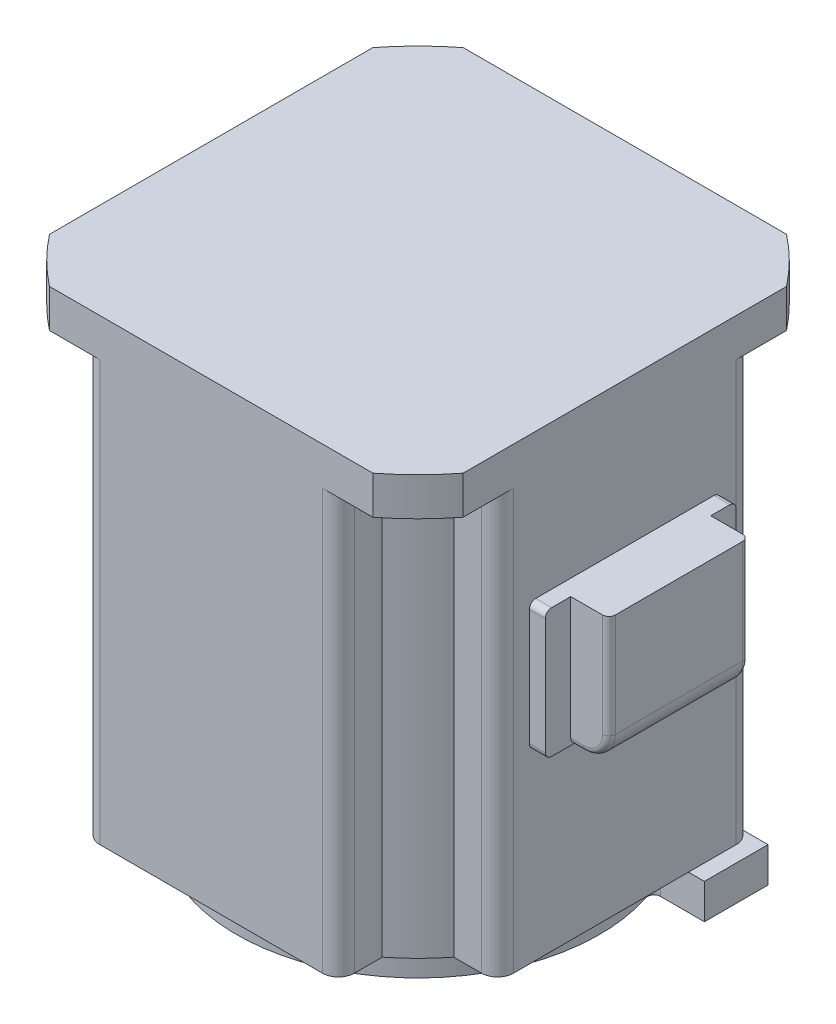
ISO-10303-21;
HEADER;
FILE_DESCRIPTION(('STEP AP214'),'2;1');
FILE_NAME('part.step','',(''),(''),'','','');
FILE_SCHEMA(('AUTOMOTIVE_DESIGN { 1 0 10303 214 1 1 1 1 }'));
ENDSEC;
DATA;
#1=APPLICATION_CONTEXT('core data for automotive mechanical design processes');
#2=APPLICATION_PROTOCOL_DEFINITION('international standard','automotive_design',2000,#1);
#3=PRODUCT_CONTEXT('',#1,'mechanical');
#4=PRODUCT('Part','Part','',(#3));
#5=PRODUCT_RELATED_PRODUCT_CATEGORY('part','',(#4));
#6=PRODUCT_DEFINITION_FORMATION('','',#4);
#7=PRODUCT_DEFINITION_CONTEXT('part definition',#1,'design');
#8=PRODUCT_DEFINITION('design','',#6,#7);
#9=PRODUCT_DEFINITION_SHAPE('','',#8);
#10=(LENGTH_UNIT() NAMED_UNIT(*) SI_UNIT(.MILLI.,.METRE.));
#11=(NAMED_UNIT(*) PLANE_ANGLE_UNIT() SI_UNIT($,.RADIAN.));
#12=(NAMED_UNIT(*) SI_UNIT($,.STERADIAN.) SOLID_ANGLE_UNIT());
#13=UNCERTAINTY_MEASURE_WITH_UNIT(LENGTH_MEASURE(1.E-05),#10,'distance_accuracy_value','');
#14=(GEOMETRIC_REPRESENTATION_CONTEXT(3) GLOBAL_UNCERTAINTY_ASSIGNED_CONTEXT((#13)) GLOBAL_UNIT_ASSIGNED_CONTEXT((#10,
#11,#12)) REPRESENTATION_CONTEXT('',''));
#15=CARTESIAN_POINT('',(0.,0.,0.));
#16=DIRECTION('',(0.,0.,1.));
#17=DIRECTION('',(1.,0.,0.));
#18=AXIS2_PLACEMENT_3D('',#15,#16,#17);
#19=CARTESIAN_POINT('',(-86.,-95.3,410.));
#20=DIRECTION('',(0.,0.,1.));
#21=DIRECTION('',(0.,1.,0.));
#22=AXIS2_PLACEMENT_3D('',#19,#20,#21);
#23=TOROIDAL_SURFACE('',#22,6.00000000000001,2.);
#24=CARTESIAN_POINT('',(-86.,-101.3,410.));
#25=DIRECTION('',(1.,0.,0.));
#26=DIRECTION('',(0.,0.,-1.));
#27=AXIS2_PLACEMENT_3D('',#24,#25,#26);
#28=CIRCLE('',#27,2.);
#29=CARTESIAN_POINT('',(-86.,-101.3,408.));
#30=VERTEX_POINT('',#29);
#31=CARTESIAN_POINT('',(-86.,-103.3,410.));
#32=VERTEX_POINT('',#31);
#33=EDGE_CURVE('E402',#30,#32,#28,.F.);
#34=ORIENTED_EDGE('',*,*,#33,.F.);
#35=CARTESIAN_POINT('',(-86.,-95.3,408.));
#36=DIRECTION('',(0.,0.,1.));
#37=DIRECTION('',(0.,-1.,0.));
#38=AXIS2_PLACEMENT_3D('',#35,#36,#37);
#39=CIRCLE('',#38,6.00000000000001);
#40=CARTESIAN_POINT('',(-80.,-95.3,408.));
#41=VERTEX_POINT('',#40);
#42=EDGE_CURVE('E434',#41,#30,#39,.F.);
#43=ORIENTED_EDGE('',*,*,#42,.F.);
#44=CARTESIAN_POINT('',(-80.,-95.3,410.));
#45=DIRECTION('',(0.,-1.,0.));
#46=DIRECTION('',(0.,0.,-1.));
#47=AXIS2_PLACEMENT_3D('',#44,#45,#46);
#48=CIRCLE('',#47,2.);
#49=CARTESIAN_POINT('',(-78.,-95.3,410.));
#50=VERTEX_POINT('',#49);
#51=EDGE_CURVE('E371',#50,#41,#48,.F.);
#52=ORIENTED_EDGE('',*,*,#51,.F.);
#53=CARTESIAN_POINT('',(-86.,-95.3,410.));
#54=DIRECTION('',(0.,0.,1.));
#55=DIRECTION('',(1.,0.,0.));
#56=AXIS2_PLACEMENT_3D('',#53,#54,#55);
#57=CIRCLE('',#56,8.);
#58=EDGE_CURVE('E401',#32,#50,#57,.T.);
#59=ORIENTED_EDGE('',*,*,#58,.F.);
#60=EDGE_LOOP('',(#34,#43,#52,#59));
#61=FACE_BOUND('',#60,.T.);
#62=ADVANCED_FACE('F17',(#61),#23,.T.);
#63=CARTESIAN_POINT('',(-86.,-95.3,450.));
#64=DIRECTION('',(0.,0.,-1.));
#65=DIRECTION('',(0.,-1.,0.));
#66=AXIS2_PLACEMENT_3D('',#63,#64,#65);
#67=TOROIDAL_SURFACE('',#66,6.00000000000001,2.);
#68=CARTESIAN_POINT('',(-80.,-95.3,450.));
#69=DIRECTION('',(0.,1.,0.));
#70=DIRECTION('',(0.,0.,1.));
#71=AXIS2_PLACEMENT_3D('',#68,#69,#70);
#72=CIRCLE('',#71,2.);
#73=CARTESIAN_POINT('',(-80.,-95.3,452.));
#74=VERTEX_POINT('',#73);
#75=CARTESIAN_POINT('',(-78.,-95.3,450.));
#76=VERTEX_POINT('',#75);
#77=EDGE_CURVE('E709',#74,#76,#72,.T.);
#78=ORIENTED_EDGE('',*,*,#77,.F.);
#79=CARTESIAN_POINT('',(-86.,-95.3,452.));
#80=DIRECTION('',(0.,0.,-1.));
#81=DIRECTION('',(1.,0.,0.));
#82=AXIS2_PLACEMENT_3D('',#79,#80,#81);
#83=CIRCLE('',#82,6.00000000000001);
#84=CARTESIAN_POINT('',(-86.,-101.3,452.));
#85=VERTEX_POINT('',#84);
#86=EDGE_CURVE('E719',#85,#74,#83,.F.);
#87=ORIENTED_EDGE('',*,*,#86,.F.);
#88=CARTESIAN_POINT('',(-86.,-101.3,450.));
#89=DIRECTION('',(1.,0.,0.));
#90=DIRECTION('',(0.,0.,-1.));
#91=AXIS2_PLACEMENT_3D('',#88,#89,#90);
#92=CIRCLE('',#91,2.);
#93=CARTESIAN_POINT('',(-86.,-103.3,450.));
#94=VERTEX_POINT('',#93);
#95=EDGE_CURVE('E395',#94,#85,#92,.F.);
#96=ORIENTED_EDGE('',*,*,#95,.F.);
#97=CARTESIAN_POINT('',(-86.,-95.3,450.));
#98=DIRECTION('',(0.,0.,1.));
#99=DIRECTION('',(1.,0.,0.));
#100=AXIS2_PLACEMENT_3D('',#97,#98,#99);
#101=CIRCLE('',#100,8.);
#102=EDGE_CURVE('E681',#76,#94,#101,.F.);
#103=ORIENTED_EDGE('',*,*,#102,.F.);
#104=EDGE_LOOP('',(#78,#87,#96,#103));
#105=FACE_BOUND('',#104,.T.);
#106=ADVANCED_FACE('F409',(#105),#67,.T.);
#107=CARTESIAN_POINT('',(-160.,-172.3,430.));
#108=DIRECTION('',(0.,1.,0.));
#109=DIRECTION('',(-1.,0.,0.));
#110=AXIS2_PLACEMENT_3D('',#107,#108,#109);
#111=PLANE('',#110);
#112=DIRECTION('',(1.,0.,0.));
#113=VECTOR('',#112,1.);
#114=CARTESIAN_POINT('',(-95.,-172.3,390.));
#115=LINE('',#114,#113);
#116=CARTESIAN_POINT('',(-118.563301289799,-172.3,390.));
#117=VERTEX_POINT('',#116);
#118=CARTESIAN_POINT('',(-90.,-172.3,390.));
#119=VERTEX_POINT('',#118);
#120=EDGE_CURVE('E620',#117,#119,#115,.T.);
#121=ORIENTED_EDGE('',*,*,#120,.T.);
#122=DIRECTION('',(0.,0.,-1.));
#123=VECTOR('',#122,1.);
#124=CARTESIAN_POINT('',(-90.,-172.3,390.));
#125=LINE('',#124,#123);
#126=CARTESIAN_POINT('',(-90.,-172.3,410.));
#127=VERTEX_POINT('',#126);
#128=EDGE_CURVE('E367',#127,#119,#125,.T.);
#129=ORIENTED_EDGE('',*,*,#128,.F.);
#130=DIRECTION('',(1.,0.,0.));
#131=VECTOR('',#130,1.);
#132=CARTESIAN_POINT('',(-90.,-172.3,410.));
#133=LINE('',#132,#131);
#134=CARTESIAN_POINT('',(-103.812812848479,-172.3,410.));
#135=VERTEX_POINT('',#134);
#136=EDGE_CURVE('E387',#135,#127,#133,.T.);
#137=ORIENTED_EDGE('',*,*,#136,.F.);
#138=CARTESIAN_POINT('',(-103.812812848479,-172.3,412.));
#139=DIRECTION('',(0.,1.,0.));
#140=DIRECTION('',(-1.,0.,0.));
#141=AXIS2_PLACEMENT_3D('',#138,#139,#140);
#142=CIRCLE('',#141,2.);
#143=CARTESIAN_POINT('',(-105.717463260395,-172.3,412.610169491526));
#144=VERTEX_POINT('',#143);
#145=EDGE_CURVE('E354',#135,#144,#142,.T.);
#146=ORIENTED_EDGE('',*,*,#145,.T.);
#147=CARTESIAN_POINT('',(-160.,-172.3,430.));
#148=DIRECTION('',(0.,-1.,0.));
#149=DIRECTION('',(1.,0.,0.));
#150=AXIS2_PLACEMENT_3D('',#147,#148,#149);
#151=CIRCLE('',#150,57.);
#152=CARTESIAN_POINT('',(-119.967935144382,-172.3,389.423728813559));
#153=VERTEX_POINT('',#152);
#154=EDGE_CURVE('E346',#153,#144,#151,.F.);
#155=ORIENTED_EDGE('',*,*,#154,.F.);
#156=CARTESIAN_POINT('',(-118.563301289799,-172.3,388.));
#157=DIRECTION('',(0.,-1.,0.));
#158=DIRECTION('',(1.,0.,0.));
#159=AXIS2_PLACEMENT_3D('',#156,#157,#158);
#160=CIRCLE('',#159,2.);
#161=EDGE_CURVE('E22',#153,#117,#160,.F.);
#162=ORIENTED_EDGE('',*,*,#161,.T.);
#163=EDGE_LOOP('',(#121,#129,#137,#146,#155,#162));
#164=FACE_BOUND('',#163,.T.);
#165=ADVANCED_FACE('F352',(#164),#111,.F.);
#166=CARTESIAN_POINT('',(-118.563301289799,-161.3,388.));
#167=DIRECTION('',(0.,-1.,0.));
#168=DIRECTION('',(1.,0.,0.));
#169=AXIS2_PLACEMENT_3D('',#166,#167,#168);
#170=CYLINDRICAL_SURFACE('',#169,2.);
#171=DIRECTION('',(0.,1.,0.));
#172=VECTOR('',#171,1.);
#173=CARTESIAN_POINT('',(-118.563301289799,-161.3,390.));
#174=LINE('',#173,#172);
#175=CARTESIAN_POINT('',(-118.563301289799,-161.3,390.));
#176=VERTEX_POINT('',#175);
#177=EDGE_CURVE('E338',#176,#117,#174,.F.);
#178=ORIENTED_EDGE('',*,*,#177,.T.);
#179=ORIENTED_EDGE('',*,*,#161,.F.);
#180=DIRECTION('',(0.,-1.,0.));
#181=VECTOR('',#180,1.);
#182=CARTESIAN_POINT('',(-119.967935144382,-161.3,389.42372881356));
#183=LINE('',#182,#181);
#184=CARTESIAN_POINT('',(-119.967935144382,-161.3,389.423728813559));
#185=VERTEX_POINT('',#184);
#186=EDGE_CURVE('E335',#185,#153,#183,.T.);
#187=ORIENTED_EDGE('',*,*,#186,.F.);
#188=CARTESIAN_POINT('',(-118.563301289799,-161.3,388.));
#189=DIRECTION('',(0.,-1.,0.));
#190=DIRECTION('',(1.,0.,0.));
#191=AXIS2_PLACEMENT_3D('',#188,#189,#190);
#192=CIRCLE('',#191,2.);
#193=EDGE_CURVE('E342',#176,#185,#192,.T.);
#194=ORIENTED_EDGE('',*,*,#193,.F.);
#195=EDGE_LOOP('',(#178,#179,#187,#194));
#196=FACE_BOUND('',#195,.T.);
#197=ADVANCED_FACE('F334',(#196),#170,.F.);
#198=CARTESIAN_POINT('',(-90.,-172.3,390.));
#199=DIRECTION('',(1.,0.,0.));
#200=DIRECTION('',(0.,0.,-1.));
#201=AXIS2_PLACEMENT_3D('',#198,#199,#200);
#202=PLANE('',#201);
#203=ORIENTED_EDGE('',*,*,#128,.T.);
#204=DIRECTION('',(0.,1.,0.));
#205=VECTOR('',#204,1.);
#206=CARTESIAN_POINT('',(-90.,-161.3,390.));
#207=LINE('',#206,#205);
#208=CARTESIAN_POINT('',(-90.,-161.3,390.));
#209=VERTEX_POINT('',#208);
#210=EDGE_CURVE('E617',#119,#209,#207,.T.);
#211=ORIENTED_EDGE('',*,*,#210,.T.);
#212=DIRECTION('',(0.,0.,1.));
#213=VECTOR('',#212,1.);
#214=CARTESIAN_POINT('',(-90.,-161.3,400.));
#215=LINE('',#214,#213);
#216=CARTESIAN_POINT('',(-90.,-161.3,410.));
#217=VERTEX_POINT('',#216);
#218=EDGE_CURVE('E611',#209,#217,#215,.T.);
#219=ORIENTED_EDGE('',*,*,#218,.T.);
#220=DIRECTION('',(0.,1.,0.));
#221=VECTOR('',#220,1.);
#222=CARTESIAN_POINT('',(-90.,-172.3,410.));
#223=LINE('',#222,#221);
#224=EDGE_CURVE('E390',#127,#217,#223,.T.);
#225=ORIENTED_EDGE('',*,*,#224,.F.);
#226=EDGE_LOOP('',(#203,#211,#219,#225));
#227=FACE_BOUND('',#226,.T.);
#228=ADVANCED_FACE('F1516',(#227),#202,.T.);
#229=CARTESIAN_POINT('',(-80.,-72.925,410.));
#230=DIRECTION('',(0.,-1.,0.));
#231=DIRECTION('',(0.,0.,-1.));
#232=AXIS2_PLACEMENT_3D('',#229,#230,#231);
#233=CYLINDRICAL_SURFACE('',#232,2.);
#234=ORIENTED_EDGE('',*,*,#51,.T.);
#235=DIRECTION('',(0.,1.,0.));
#236=VECTOR('',#235,1.);
#237=CARTESIAN_POINT('',(-80.,-62.8,408.));
#238=LINE('',#237,#236);
#239=CARTESIAN_POINT('',(-80.,-62.8,408.));
#240=VERTEX_POINT('',#239);
#241=EDGE_CURVE('E379',#240,#41,#238,.F.);
#242=ORIENTED_EDGE('',*,*,#241,.F.);
#243=CARTESIAN_POINT('',(-80.,-62.8,410.));
#244=DIRECTION('',(0.,-1.,0.));
#245=DIRECTION('',(0.,0.,-1.));
#246=AXIS2_PLACEMENT_3D('',#243,#244,#245);
#247=CIRCLE('',#246,2.);
#248=CARTESIAN_POINT('',(-78.,-62.8,410.));
#249=VERTEX_POINT('',#248);
#250=EDGE_CURVE('E573',#249,#240,#247,.F.);
#251=ORIENTED_EDGE('',*,*,#250,.F.);
#252=DIRECTION('',(0.,1.,0.));
#253=VECTOR('',#252,1.);
#254=CARTESIAN_POINT('',(-78.,-83.05,410.));
#255=LINE('',#254,#253);
#256=EDGE_CURVE('E698',#249,#50,#255,.F.);
#257=ORIENTED_EDGE('',*,*,#256,.T.);
#258=EDGE_LOOP('',(#234,#242,#251,#257));
#259=FACE_BOUND('',#258,.T.);
#260=ADVANCED_FACE('F749',(#259),#233,.T.);
#261=CARTESIAN_POINT('',(-95.,-62.8,408.));
#262=DIRECTION('',(0.,0.,-1.));
#263=DIRECTION('',(0.,1.,0.));
#264=AXIS2_PLACEMENT_3D('',#261,#262,#263);
#265=PLANE('',#264);
#266=DIRECTION('',(0.,-1.,0.));
#267=VECTOR('',#266,1.);
#268=CARTESIAN_POINT('',(-90.,-83.05,408.));
#269=LINE('',#268,#267);
#270=CARTESIAN_POINT('',(-90.,-101.3,408.));
#271=VERTEX_POINT('',#270);
#272=CARTESIAN_POINT('',(-90.,-62.8,408.));
#273=VERTEX_POINT('',#272);
#274=EDGE_CURVE('E365',#271,#273,#269,.F.);
#275=ORIENTED_EDGE('',*,*,#274,.T.);
#276=DIRECTION('',(-1.,0.,0.));
#277=VECTOR('',#276,1.);
#278=CARTESIAN_POINT('',(-95.,-62.8,408.));
#279=LINE('',#278,#277);
#280=EDGE_CURVE('E575',#240,#273,#279,.T.);
#281=ORIENTED_EDGE('',*,*,#280,.F.);
#282=ORIENTED_EDGE('',*,*,#241,.T.);
#283=ORIENTED_EDGE('',*,*,#42,.T.);
#284=DIRECTION('',(1.,0.,0.));
#285=VECTOR('',#284,1.);
#286=CARTESIAN_POINT('',(-95.,-101.3,408.));
#287=LINE('',#286,#285);
#288=EDGE_CURVE('E398',#271,#30,#287,.T.);
#289=ORIENTED_EDGE('',*,*,#288,.F.);
#290=EDGE_LOOP('',(#275,#281,#282,#283,#289));
#291=FACE_BOUND('',#290,.T.);
#292=ADVANCED_FACE('F744',(#291),#265,.T.);
#293=CARTESIAN_POINT('',(-95.,-103.3,452.));
#294=DIRECTION('',(0.,0.,1.));
#295=DIRECTION('',(0.,-1.,0.));
#296=AXIS2_PLACEMENT_3D('',#293,#294,#295);
#297=PLANE('',#296);
#298=DIRECTION('',(-1.,0.,0.));
#299=VECTOR('',#298,1.);
#300=CARTESIAN_POINT('',(-95.,-62.8,452.));
#301=LINE('',#300,#299);
#302=CARTESIAN_POINT('',(-90.,-62.8,452.));
#303=VERTEX_POINT('',#302);
#304=CARTESIAN_POINT('',(-80.,-62.8,452.));
#305=VERTEX_POINT('',#304);
#306=EDGE_CURVE('E572',#303,#305,#301,.F.);
#307=ORIENTED_EDGE('',*,*,#306,.F.);
#308=DIRECTION('',(0.,-1.,0.));
#309=VECTOR('',#308,1.);
#310=CARTESIAN_POINT('',(-90.,-83.05,452.));
#311=LINE('',#310,#309);
#312=CARTESIAN_POINT('',(-90.,-101.3,452.));
#313=VERTEX_POINT('',#312);
#314=EDGE_CURVE('E362',#303,#313,#311,.T.);
#315=ORIENTED_EDGE('',*,*,#314,.T.);
#316=DIRECTION('',(1.,0.,0.));
#317=VECTOR('',#316,1.);
#318=CARTESIAN_POINT('',(-95.,-101.3,452.));
#319=LINE('',#318,#317);
#320=EDGE_CURVE('E366',#85,#313,#319,.F.);
#321=ORIENTED_EDGE('',*,*,#320,.F.);
#322=ORIENTED_EDGE('',*,*,#86,.T.);
#323=DIRECTION('',(0.,1.,0.));
#324=VECTOR('',#323,1.);
#325=CARTESIAN_POINT('',(-80.,-93.175,452.));
#326=LINE('',#325,#324);
#327=EDGE_CURVE('E716',#305,#74,#326,.F.);
#328=ORIENTED_EDGE('',*,*,#327,.F.);
#329=EDGE_LOOP('',(#307,#315,#321,#322,#328));
#330=FACE_BOUND('',#329,.T.);
#331=ADVANCED_FACE('F733',(#330),#297,.T.);
#332=CARTESIAN_POINT('',(-80.,-93.175,450.));
#333=DIRECTION('',(0.,1.,0.));
#334=DIRECTION('',(0.,0.,1.));
#335=AXIS2_PLACEMENT_3D('',#332,#333,#334);
#336=CYLINDRICAL_SURFACE('',#335,2.);
#337=ORIENTED_EDGE('',*,*,#77,.T.);
#338=DIRECTION('',(0.,1.,0.));
#339=VECTOR('',#338,1.);
#340=CARTESIAN_POINT('',(-78.,-83.05,450.));
#341=LINE('',#340,#339);
#342=CARTESIAN_POINT('',(-78.,-62.8,450.));
#343=VERTEX_POINT('',#342);
#344=EDGE_CURVE('E706',#76,#343,#341,.T.);
#345=ORIENTED_EDGE('',*,*,#344,.T.);
#346=CARTESIAN_POINT('',(-80.,-62.8,450.));
#347=DIRECTION('',(0.,1.,0.));
#348=DIRECTION('',(0.,0.,1.));
#349=AXIS2_PLACEMENT_3D('',#346,#347,#348);
#350=CIRCLE('',#349,2.);
#351=EDGE_CURVE('E570',#305,#343,#350,.T.);
#352=ORIENTED_EDGE('',*,*,#351,.F.);
#353=ORIENTED_EDGE('',*,*,#327,.T.);
#354=EDGE_LOOP('',(#337,#345,#352,#353));
#355=FACE_BOUND('',#354,.T.);
#356=ADVANCED_FACE('F743',(#355),#336,.T.);
#357=CARTESIAN_POINT('',(-78.,-83.05,430.));
#358=DIRECTION('',(-1.,0.,0.));
#359=DIRECTION('',(0.,0.,1.));
#360=AXIS2_PLACEMENT_3D('',#357,#358,#359);
#361=PLANE('',#360);
#362=DIRECTION('',(0.,0.,1.));
#363=VECTOR('',#362,1.);
#364=CARTESIAN_POINT('',(-78.,-62.8,452.));
#365=LINE('',#364,#363);
#366=EDGE_CURVE('E569',#343,#249,#365,.F.);
#367=ORIENTED_EDGE('',*,*,#366,.F.);
#368=ORIENTED_EDGE('',*,*,#344,.F.);
#369=DIRECTION('',(0.,0.,1.));
#370=VECTOR('',#369,1.);
#371=CARTESIAN_POINT('',(-78.,-95.3,430.));
#372=LINE('',#371,#370);
#373=EDGE_CURVE('E407',#50,#76,#372,.T.);
#374=ORIENTED_EDGE('',*,*,#373,.F.);
#375=ORIENTED_EDGE('',*,*,#256,.F.);
#376=EDGE_LOOP('',(#367,#368,#374,#375));
#377=FACE_BOUND('',#376,.T.);
#378=ADVANCED_FACE('F1484',(#377),#361,.F.);
#379=CARTESIAN_POINT('',(-95.,-101.3,410.));
#380=DIRECTION('',(1.,0.,0.));
#381=DIRECTION('',(0.,0.,-1.));
#382=AXIS2_PLACEMENT_3D('',#379,#380,#381);
#383=CYLINDRICAL_SURFACE('',#382,2.);
#384=CARTESIAN_POINT('',(-90.,-101.3,410.));
#385=DIRECTION('',(1.,0.,0.));
#386=DIRECTION('',(0.,0.,-1.));
#387=AXIS2_PLACEMENT_3D('',#384,#385,#386);
#388=CIRCLE('',#387,2.);
#389=CARTESIAN_POINT('',(-90.,-103.3,410.));
#390=VERTEX_POINT('',#389);
#391=EDGE_CURVE('E363',#390,#271,#388,.T.);
#392=ORIENTED_EDGE('',*,*,#391,.T.);
#393=ORIENTED_EDGE('',*,*,#288,.T.);
#394=ORIENTED_EDGE('',*,*,#33,.T.);
#395=DIRECTION('',(1.,0.,0.));
#396=VECTOR('',#395,1.);
#397=CARTESIAN_POINT('',(-95.,-103.3,410.));
#398=LINE('',#397,#396);
#399=EDGE_CURVE('E670',#390,#32,#398,.T.);
#400=ORIENTED_EDGE('',*,*,#399,.F.);
#401=EDGE_LOOP('',(#392,#393,#394,#400));
#402=FACE_BOUND('',#401,.T.);
#403=ADVANCED_FACE('F767',(#402),#383,.T.);
#404=CARTESIAN_POINT('',(-86.,-95.3,430.));
#405=DIRECTION('',(0.,0.,1.));
#406=DIRECTION('',(1.,0.,0.));
#407=AXIS2_PLACEMENT_3D('',#404,#405,#406);
#408=CYLINDRICAL_SURFACE('',#407,8.);
#409=ORIENTED_EDGE('',*,*,#102,.T.);
#410=DIRECTION('',(0.,0.,1.));
#411=VECTOR('',#410,1.);
#412=CARTESIAN_POINT('',(-86.,-103.3,430.));
#413=LINE('',#412,#411);
#414=EDGE_CURVE('E673',#32,#94,#413,.T.);
#415=ORIENTED_EDGE('',*,*,#414,.F.);
#416=ORIENTED_EDGE('',*,*,#58,.T.);
#417=ORIENTED_EDGE('',*,*,#373,.T.);
#418=EDGE_LOOP('',(#409,#415,#416,#417));
#419=FACE_BOUND('',#418,.T.);
#420=ADVANCED_FACE('F774',(#419),#408,.T.);
#421=CARTESIAN_POINT('',(-95.,-101.3,450.));
#422=DIRECTION('',(1.,0.,0.));
#423=DIRECTION('',(0.,0.,-1.));
#424=AXIS2_PLACEMENT_3D('',#421,#422,#423);
#425=CYLINDRICAL_SURFACE('',#424,2.);
#426=ORIENTED_EDGE('',*,*,#95,.T.);
#427=ORIENTED_EDGE('',*,*,#320,.T.);
#428=CARTESIAN_POINT('',(-90.,-101.3,450.));
#429=DIRECTION('',(1.,0.,0.));
#430=DIRECTION('',(0.,0.,-1.));
#431=AXIS2_PLACEMENT_3D('',#428,#429,#430);
#432=CIRCLE('',#431,2.);
#433=CARTESIAN_POINT('',(-90.,-103.3,450.));
#434=VERTEX_POINT('',#433);
#435=EDGE_CURVE('E349',#313,#434,#432,.T.);
#436=ORIENTED_EDGE('',*,*,#435,.T.);
#437=DIRECTION('',(1.,0.,0.));
#438=VECTOR('',#437,1.);
#439=CARTESIAN_POINT('',(-95.,-103.3,450.));
#440=LINE('',#439,#438);
#441=EDGE_CURVE('E663',#94,#434,#440,.F.);
#442=ORIENTED_EDGE('',*,*,#441,.F.);
#443=EDGE_LOOP('',(#426,#427,#436,#442));
#444=FACE_BOUND('',#443,.T.);
#445=ADVANCED_FACE('F785',(#444),#425,.T.);
#446=CARTESIAN_POINT('',(-90.,-83.05,404.));
#447=DIRECTION('',(-1.,0.,0.));
#448=DIRECTION('',(0.,-1.,0.));
#449=AXIS2_PLACEMENT_3D('',#446,#447,#448);
#450=PLANE('',#449);
#451=DIRECTION('',(0.,0.,1.));
#452=VECTOR('',#451,1.);
#453=CARTESIAN_POINT('',(-90.,-62.8,452.));
#454=LINE('',#453,#452);
#455=CARTESIAN_POINT('',(-90.,-62.8,402.));
#456=VERTEX_POINT('',#455);
#457=EDGE_CURVE('E653',#273,#456,#454,.F.);
#458=ORIENTED_EDGE('',*,*,#457,.F.);
#459=ORIENTED_EDGE('',*,*,#274,.F.);
#460=ORIENTED_EDGE('',*,*,#391,.F.);
#461=DIRECTION('',(0.,0.,1.));
#462=VECTOR('',#461,1.);
#463=CARTESIAN_POINT('',(-90.,-103.3,430.));
#464=LINE('',#463,#462);
#465=CARTESIAN_POINT('',(-90.,-103.3,402.));
#466=VERTEX_POINT('',#465);
#467=EDGE_CURVE('E561',#466,#390,#464,.T.);
#468=ORIENTED_EDGE('',*,*,#467,.F.);
#469=CARTESIAN_POINT('',(-90.,-101.3,402.));
#470=DIRECTION('',(1.,0.,0.));
#471=DIRECTION('',(0.,1.,0.));
#472=AXIS2_PLACEMENT_3D('',#469,#470,#471);
#473=CIRCLE('',#472,2.);
#474=CARTESIAN_POINT('',(-90.,-101.3,400.));
#475=VERTEX_POINT('',#474);
#476=EDGE_CURVE('E562',#475,#466,#473,.F.);
#477=ORIENTED_EDGE('',*,*,#476,.F.);
#478=DIRECTION('',(0.,1.,0.));
#479=VECTOR('',#478,1.);
#480=CARTESIAN_POINT('',(-90.,-62.8,400.));
#481=LINE('',#480,#479);
#482=CARTESIAN_POINT('',(-90.,-64.8,400.));
#483=VERTEX_POINT('',#482);
#484=EDGE_CURVE('E565',#483,#475,#481,.F.);
#485=ORIENTED_EDGE('',*,*,#484,.F.);
#486=CARTESIAN_POINT('',(-90.,-64.8,402.));
#487=DIRECTION('',(1.,0.,0.));
#488=DIRECTION('',(0.,1.,0.));
#489=AXIS2_PLACEMENT_3D('',#486,#487,#488);
#490=CIRCLE('',#489,2.);
#491=EDGE_CURVE('E566',#456,#483,#490,.F.);
#492=ORIENTED_EDGE('',*,*,#491,.F.);
#493=EDGE_LOOP('',(#458,#459,#460,#468,#477,#485,#492));
#494=FACE_BOUND('',#493,.T.);
#495=ADVANCED_FACE('F1454',(#494),#450,.F.);
#496=CARTESIAN_POINT('',(-90.,-83.05,456.));
#497=DIRECTION('',(-1.,0.,0.));
#498=DIRECTION('',(0.,-1.,0.));
#499=AXIS2_PLACEMENT_3D('',#496,#497,#498);
#500=PLANE('',#499);
#501=DIRECTION('',(0.,-1.,0.));
#502=VECTOR('',#501,1.);
#503=CARTESIAN_POINT('',(-90.,-103.3,460.));
#504=LINE('',#503,#502);
#505=CARTESIAN_POINT('',(-90.,-101.3,460.));
#506=VERTEX_POINT('',#505);
#507=CARTESIAN_POINT('',(-90.,-64.8,460.));
#508=VERTEX_POINT('',#507);
#509=EDGE_CURVE('E557',#506,#508,#504,.F.);
#510=ORIENTED_EDGE('',*,*,#509,.F.);
#511=CARTESIAN_POINT('',(-90.,-101.3,458.));
#512=DIRECTION('',(1.,0.,0.));
#513=DIRECTION('',(0.,1.,0.));
#514=AXIS2_PLACEMENT_3D('',#511,#512,#513);
#515=CIRCLE('',#514,2.);
#516=CARTESIAN_POINT('',(-90.,-103.3,458.));
#517=VERTEX_POINT('',#516);
#518=EDGE_CURVE('E558',#517,#506,#515,.F.);
#519=ORIENTED_EDGE('',*,*,#518,.F.);
#520=DIRECTION('',(0.,0.,1.));
#521=VECTOR('',#520,1.);
#522=CARTESIAN_POINT('',(-90.,-103.3,430.));
#523=LINE('',#522,#521);
#524=EDGE_CURVE('E660',#434,#517,#523,.T.);
#525=ORIENTED_EDGE('',*,*,#524,.F.);
#526=ORIENTED_EDGE('',*,*,#435,.F.);
#527=ORIENTED_EDGE('',*,*,#314,.F.);
#528=DIRECTION('',(0.,0.,1.));
#529=VECTOR('',#528,1.);
#530=CARTESIAN_POINT('',(-90.,-62.8,452.));
#531=LINE('',#530,#529);
#532=CARTESIAN_POINT('',(-90.,-62.8,458.));
#533=VERTEX_POINT('',#532);
#534=EDGE_CURVE('E650',#533,#303,#531,.F.);
#535=ORIENTED_EDGE('',*,*,#534,.F.);
#536=CARTESIAN_POINT('',(-90.,-64.8,458.));
#537=DIRECTION('',(1.,0.,0.));
#538=DIRECTION('',(0.,1.,0.));
#539=AXIS2_PLACEMENT_3D('',#536,#537,#538);
#540=CIRCLE('',#539,2.);
#541=EDGE_CURVE('E554',#508,#533,#540,.F.);
#542=ORIENTED_EDGE('',*,*,#541,.F.);
#543=EDGE_LOOP('',(#510,#519,#525,#526,#527,#535,#542));
#544=FACE_BOUND('',#543,.T.);
#545=ADVANCED_FACE('F792',(#544),#500,.F.);
#546=CARTESIAN_POINT('',(-160.,-161.3,430.));
#547=DIRECTION('',(0.,-1.,0.));
#548=DIRECTION('',(1.,0.,0.));
#549=AXIS2_PLACEMENT_3D('',#546,#547,#548);
#550=CYLINDRICAL_SURFACE('',#549,57.);
#551=DIRECTION('',(0.,1.,0.));
#552=VECTOR('',#551,1.);
#553=CARTESIAN_POINT('',(-105.717463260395,-161.3,412.610169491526));
#554=LINE('',#553,#552);
#555=CARTESIAN_POINT('',(-105.717463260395,-161.3,412.610169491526));
#556=VERTEX_POINT('',#555);
#557=EDGE_CURVE('E356',#144,#556,#554,.T.);
#558=ORIENTED_EDGE('',*,*,#557,.T.);
#559=CARTESIAN_POINT('',(-160.,-161.3,430.));
#560=DIRECTION('',(0.,-1.,0.));
#561=DIRECTION('',(1.,0.,0.));
#562=AXIS2_PLACEMENT_3D('',#559,#560,#561);
#563=CIRCLE('',#562,57.);
#564=EDGE_CURVE('E348',#185,#556,#563,.F.);
#565=ORIENTED_EDGE('',*,*,#564,.F.);
#566=ORIENTED_EDGE('',*,*,#186,.T.);
#567=ORIENTED_EDGE('',*,*,#154,.T.);
#568=EDGE_LOOP('',(#558,#565,#566,#567));
#569=FACE_BOUND('',#568,.T.);
#570=ADVANCED_FACE('F345',(#569),#550,.T.);
#571=CARTESIAN_POINT('',(-103.812812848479,-161.3,412.));
#572=DIRECTION('',(0.,1.,0.));
#573=DIRECTION('',(-1.,0.,0.));
#574=AXIS2_PLACEMENT_3D('',#571,#572,#573);
#575=CYLINDRICAL_SURFACE('',#574,2.);
#576=ORIENTED_EDGE('',*,*,#557,.F.);
#577=ORIENTED_EDGE('',*,*,#145,.F.);
#578=DIRECTION('',(0.,1.,0.));
#579=VECTOR('',#578,1.);
#580=CARTESIAN_POINT('',(-103.812812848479,-172.3,410.));
#581=LINE('',#580,#579);
#582=CARTESIAN_POINT('',(-103.812812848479,-161.3,410.));
#583=VERTEX_POINT('',#582);
#584=EDGE_CURVE('E391',#583,#135,#581,.F.);
#585=ORIENTED_EDGE('',*,*,#584,.F.);
#586=CARTESIAN_POINT('',(-103.812812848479,-161.3,412.));
#587=DIRECTION('',(0.,1.,0.));
#588=DIRECTION('',(-1.,0.,0.));
#589=AXIS2_PLACEMENT_3D('',#586,#587,#588);
#590=CIRCLE('',#589,2.);
#591=EDGE_CURVE('E528',#556,#583,#590,.F.);
#592=ORIENTED_EDGE('',*,*,#591,.F.);
#593=EDGE_LOOP('',(#576,#577,#585,#592));
#594=FACE_BOUND('',#593,.T.);
#595=ADVANCED_FACE('F1431',(#594),#575,.F.);
#596=CARTESIAN_POINT('',(-90.,-172.3,410.));
#597=DIRECTION('',(0.,0.,1.));
#598=DIRECTION('',(1.,0.,0.));
#599=AXIS2_PLACEMENT_3D('',#596,#597,#598);
#600=PLANE('',#599);
#601=DIRECTION('',(1.,0.,0.));
#602=VECTOR('',#601,1.);
#603=CARTESIAN_POINT('',(-104.696059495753,-161.3,410.));
#604=LINE('',#603,#602);
#605=CARTESIAN_POINT('',(-95.,-161.3,410.));
#606=VERTEX_POINT('',#605);
#607=EDGE_CURVE('E579',#217,#606,#604,.F.);
#608=ORIENTED_EDGE('',*,*,#607,.T.);
#609=DIRECTION('',(1.,0.,0.));
#610=VECTOR('',#609,1.);
#611=CARTESIAN_POINT('',(-160.,-161.3,410.));
#612=LINE('',#611,#610);
#613=EDGE_CURVE('E527',#583,#606,#612,.T.);
#614=ORIENTED_EDGE('',*,*,#613,.F.);
#615=ORIENTED_EDGE('',*,*,#584,.T.);
#616=ORIENTED_EDGE('',*,*,#136,.T.);
#617=ORIENTED_EDGE('',*,*,#224,.T.);
#618=EDGE_LOOP('',(#608,#614,#615,#616,#617));
#619=FACE_BOUND('',#618,.T.);
#620=ADVANCED_FACE('F1040',(#619),#600,.T.);
#621=CARTESIAN_POINT('',(-108.765246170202,-161.3,470.));
#622=DIRECTION('',(0.,0.,-1.));
#623=DIRECTION('',(-1.,0.,0.));
#624=AXIS2_PLACEMENT_3D('',#621,#622,#623);
#625=PLANE('',#624);
#626=DIRECTION('',(1.,0.,0.));
#627=VECTOR('',#626,1.);
#628=CARTESIAN_POINT('',(-106.307776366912,-29.3,470.));
#629=LINE('',#628,#627);
#630=CARTESIAN_POINT('',(-108.765246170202,-29.3,470.));
#631=VERTEX_POINT('',#630);
#632=CARTESIAN_POINT('',(-100.,-29.3,470.));
#633=VERTEX_POINT('',#632);
#634=EDGE_CURVE('E549',#631,#633,#629,.T.);
#635=ORIENTED_EDGE('',*,*,#634,.F.);
#636=DIRECTION('',(0.,1.,0.));
#637=VECTOR('',#636,1.);
#638=CARTESIAN_POINT('',(-108.765246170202,-161.3,470.));
#639=LINE('',#638,#637);
#640=CARTESIAN_POINT('',(-108.765246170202,-161.3,470.));
#641=VERTEX_POINT('',#640);
#642=EDGE_CURVE('E608',#641,#631,#639,.T.);
#643=ORIENTED_EDGE('',*,*,#642,.F.);
#644=DIRECTION('',(1.,0.,0.));
#645=VECTOR('',#644,1.);
#646=CARTESIAN_POINT('',(-160.,-161.3,470.));
#647=LINE('',#646,#645);
#648=CARTESIAN_POINT('',(-100.,-161.3,470.));
#649=VERTEX_POINT('',#648);
#650=EDGE_CURVE('E523',#649,#641,#647,.F.);
#651=ORIENTED_EDGE('',*,*,#650,.F.);
#652=DIRECTION('',(0.,-1.,0.));
#653=VECTOR('',#652,1.);
#654=CARTESIAN_POINT('',(-100.,-161.3,470.));
#655=LINE('',#654,#653);
#656=EDGE_CURVE('E582',#633,#649,#655,.T.);
#657=ORIENTED_EDGE('',*,*,#656,.F.);
#658=EDGE_LOOP('',(#635,#643,#651,#657));
#659=FACE_BOUND('',#658,.T.);
#660=ADVANCED_FACE('F1414',(#659),#625,.F.);
#661=CARTESIAN_POINT('',(-160.,-161.3,430.));
#662=DIRECTION('',(0.,1.,0.));
#663=DIRECTION('',(-1.,0.,0.));
#664=AXIS2_PLACEMENT_3D('',#661,#662,#663);
#665=CYLINDRICAL_SURFACE('',#664,65.);
#666=CARTESIAN_POINT('',(-160.,-161.3,430.));
#667=DIRECTION('',(0.,1.,0.));
#668=DIRECTION('',(-1.,0.,0.));
#669=AXIS2_PLACEMENT_3D('',#666,#667,#668);
#670=CIRCLE('',#669,65.);
#671=CARTESIAN_POINT('',(-120.,-161.3,481.234753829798));
#672=VERTEX_POINT('',#671);
#673=EDGE_CURVE('E521',#641,#672,#670,.F.);
#674=ORIENTED_EDGE('',*,*,#673,.F.);
#675=ORIENTED_EDGE('',*,*,#642,.T.);
#676=CARTESIAN_POINT('',(-160.,-29.3,430.));
#677=DIRECTION('',(0.,1.,0.));
#678=DIRECTION('',(-1.,0.,0.));
#679=AXIS2_PLACEMENT_3D('',#676,#677,#678);
#680=CIRCLE('',#679,65.);
#681=CARTESIAN_POINT('',(-120.,-29.3,481.234753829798));
#682=VERTEX_POINT('',#681);
#683=EDGE_CURVE('E550',#682,#631,#680,.T.);
#684=ORIENTED_EDGE('',*,*,#683,.F.);
#685=DIRECTION('',(0.,1.,0.));
#686=VECTOR('',#685,1.);
#687=CARTESIAN_POINT('',(-120.,-161.3,481.234753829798));
#688=LINE('',#687,#686);
#689=EDGE_CURVE('E638',#682,#672,#688,.F.);
#690=ORIENTED_EDGE('',*,*,#689,.T.);
#691=EDGE_LOOP('',(#674,#675,#684,#690));
#692=FACE_BOUND('',#691,.T.);
#693=ADVANCED_FACE('F1405',(#692),#665,.T.);
#694=CARTESIAN_POINT('',(-120.,-161.3,495.));
#695=DIRECTION('',(-1.,0.,0.));
#696=DIRECTION('',(0.,0.,1.));
#697=AXIS2_PLACEMENT_3D('',#694,#695,#696);
#698=PLANE('',#697);
#699=DIRECTION('',(0.,0.,1.));
#700=VECTOR('',#699,1.);
#701=CARTESIAN_POINT('',(-120.,-161.3,430.));
#702=LINE('',#701,#700);
#703=CARTESIAN_POINT('',(-120.,-161.3,490.));
#704=VERTEX_POINT('',#703);
#705=EDGE_CURVE('E520',#672,#704,#702,.T.);
#706=ORIENTED_EDGE('',*,*,#705,.F.);
#707=ORIENTED_EDGE('',*,*,#689,.F.);
#708=DIRECTION('',(0.,0.,1.));
#709=VECTOR('',#708,1.);
#710=CARTESIAN_POINT('',(-120.,-29.3,483.692223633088));
#711=LINE('',#710,#709);
#712=CARTESIAN_POINT('',(-120.,-29.3,490.));
#713=VERTEX_POINT('',#712);
#714=EDGE_CURVE('E553',#713,#682,#711,.F.);
#715=ORIENTED_EDGE('',*,*,#714,.F.);
#716=DIRECTION('',(0.,1.,0.));
#717=VECTOR('',#716,1.);
#718=CARTESIAN_POINT('',(-120.,-161.3,490.));
#719=LINE('',#718,#717);
#720=EDGE_CURVE('E545',#704,#713,#719,.T.);
#721=ORIENTED_EDGE('',*,*,#720,.F.);
#722=EDGE_LOOP('',(#706,#707,#715,#721));
#723=FACE_BOUND('',#722,.T.);
#724=ADVANCED_FACE('F1396',(#723),#698,.F.);
#725=CARTESIAN_POINT('',(-200.,-161.3,481.234753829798));
#726=DIRECTION('',(1.,0.,0.));
#727=DIRECTION('',(0.,0.,-1.));
#728=AXIS2_PLACEMENT_3D('',#725,#726,#727);
#729=PLANE('',#728);
#730=DIRECTION('',(0.,0.,1.));
#731=VECTOR('',#730,1.);
#732=CARTESIAN_POINT('',(-200.,-29.3,483.692223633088));
#733=LINE('',#732,#731);
#734=CARTESIAN_POINT('',(-200.,-29.3,481.234753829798));
#735=VERTEX_POINT('',#734);
#736=CARTESIAN_POINT('',(-200.,-29.3,490.));
#737=VERTEX_POINT('',#736);
#738=EDGE_CURVE('E534',#735,#737,#733,.T.);
#739=ORIENTED_EDGE('',*,*,#738,.F.);
#740=DIRECTION('',(0.,1.,0.));
#741=VECTOR('',#740,1.);
#742=CARTESIAN_POINT('',(-200.,-161.3,481.234753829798));
#743=LINE('',#742,#741);
#744=CARTESIAN_POINT('',(-200.,-161.3,481.234753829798));
#745=VERTEX_POINT('',#744);
#746=EDGE_CURVE('E631',#745,#735,#743,.T.);
#747=ORIENTED_EDGE('',*,*,#746,.F.);
#748=DIRECTION('',(0.,0.,1.));
#749=VECTOR('',#748,1.);
#750=CARTESIAN_POINT('',(-200.,-161.3,430.));
#751=LINE('',#750,#749);
#752=CARTESIAN_POINT('',(-200.,-161.3,490.));
#753=VERTEX_POINT('',#752);
#754=EDGE_CURVE('E514',#753,#745,#751,.F.);
#755=ORIENTED_EDGE('',*,*,#754,.F.);
#756=DIRECTION('',(0.,-1.,0.));
#757=VECTOR('',#756,1.);
#758=CARTESIAN_POINT('',(-200.,-161.3,490.));
#759=LINE('',#758,#757);
#760=EDGE_CURVE('E548',#737,#753,#759,.T.);
#761=ORIENTED_EDGE('',*,*,#760,.F.);
#762=EDGE_LOOP('',(#739,#747,#755,#761));
#763=FACE_BOUND('',#762,.T.);
#764=ADVANCED_FACE('F1387',(#763),#729,.F.);
#765=CARTESIAN_POINT('',(-160.,-161.3,430.));
#766=DIRECTION('',(0.,1.,0.));
#767=DIRECTION('',(-1.,0.,0.));
#768=AXIS2_PLACEMENT_3D('',#765,#766,#767);
#769=CYLINDRICAL_SURFACE('',#768,65.);
#770=CARTESIAN_POINT('',(-160.,-161.3,430.));
#771=DIRECTION('',(0.,1.,0.));
#772=DIRECTION('',(-1.,0.,0.));
#773=AXIS2_PLACEMENT_3D('',#770,#771,#772);
#774=CIRCLE('',#773,65.);
#775=CARTESIAN_POINT('',(-211.234753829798,-161.3,470.));
#776=VERTEX_POINT('',#775);
#777=EDGE_CURVE('E512',#745,#776,#774,.F.);
#778=ORIENTED_EDGE('',*,*,#777,.F.);
#779=ORIENTED_EDGE('',*,*,#746,.T.);
#780=CARTESIAN_POINT('',(-160.,-29.3,430.));
#781=DIRECTION('',(0.,1.,0.));
#782=DIRECTION('',(-1.,0.,0.));
#783=AXIS2_PLACEMENT_3D('',#780,#781,#782);
#784=CIRCLE('',#783,65.);
#785=CARTESIAN_POINT('',(-211.234753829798,-29.3,470.));
#786=VERTEX_POINT('',#785);
#787=EDGE_CURVE('E535',#786,#735,#784,.T.);
#788=ORIENTED_EDGE('',*,*,#787,.F.);
#789=DIRECTION('',(0.,1.,0.));
#790=VECTOR('',#789,1.);
#791=CARTESIAN_POINT('',(-211.234753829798,-161.3,470.));
#792=LINE('',#791,#790);
#793=EDGE_CURVE('E624',#786,#776,#792,.F.);
#794=ORIENTED_EDGE('',*,*,#793,.T.);
#795=EDGE_LOOP('',(#778,#779,#788,#794));
#796=FACE_BOUND('',#795,.T.);
#797=ADVANCED_FACE('F1378',(#796),#769,.T.);
#798=CARTESIAN_POINT('',(-225.,-161.3,470.));
#799=DIRECTION('',(0.,0.,-1.));
#800=DIRECTION('',(-1.,0.,0.));
#801=AXIS2_PLACEMENT_3D('',#798,#799,#800);
#802=PLANE('',#801);
#803=DIRECTION('',(1.,0.,0.));
#804=VECTOR('',#803,1.);
#805=CARTESIAN_POINT('',(-160.,-161.3,470.));
#806=LINE('',#805,#804);
#807=CARTESIAN_POINT('',(-220.,-161.3,470.));
#808=VERTEX_POINT('',#807);
#809=EDGE_CURVE('E511',#776,#808,#806,.F.);
#810=ORIENTED_EDGE('',*,*,#809,.F.);
#811=ORIENTED_EDGE('',*,*,#793,.F.);
#812=DIRECTION('',(1.,0.,0.));
#813=VECTOR('',#812,1.);
#814=CARTESIAN_POINT('',(-213.692223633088,-29.3,470.));
#815=LINE('',#814,#813);
#816=CARTESIAN_POINT('',(-220.,-29.3,470.));
#817=VERTEX_POINT('',#816);
#818=EDGE_CURVE('E538',#817,#786,#815,.T.);
#819=ORIENTED_EDGE('',*,*,#818,.F.);
#820=DIRECTION('',(0.,1.,0.));
#821=VECTOR('',#820,1.);
#822=CARTESIAN_POINT('',(-220.,-161.3,470.));
#823=LINE('',#822,#821);
#824=EDGE_CURVE('E542',#808,#817,#823,.T.);
#825=ORIENTED_EDGE('',*,*,#824,.F.);
#826=EDGE_LOOP('',(#810,#811,#819,#825));
#827=FACE_BOUND('',#826,.T.);
#828=ADVANCED_FACE('F1369',(#827),#802,.F.);
#829=CARTESIAN_POINT('',(-120.,-161.3,378.765246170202));
#830=DIRECTION('',(-1.,0.,0.));
#831=DIRECTION('',(0.,0.,1.));
#832=AXIS2_PLACEMENT_3D('',#829,#830,#831);
#833=PLANE('',#832);
#834=DIRECTION('',(0.,0.,1.));
#835=VECTOR('',#834,1.);
#836=CARTESIAN_POINT('',(-120.,-29.3,376.307776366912));
#837=LINE('',#836,#835);
#838=CARTESIAN_POINT('',(-120.,-29.3,378.765246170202));
#839=VERTEX_POINT('',#838);
#840=CARTESIAN_POINT('',(-120.,-29.3,370.));
#841=VERTEX_POINT('',#840);
#842=EDGE_CURVE('E583',#839,#841,#837,.F.);
#843=ORIENTED_EDGE('',*,*,#842,.F.);
#844=DIRECTION('',(0.,1.,0.));
#845=VECTOR('',#844,1.);
#846=CARTESIAN_POINT('',(-120.,-161.3,378.765246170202));
#847=LINE('',#846,#845);
#848=CARTESIAN_POINT('',(-120.,-161.3,378.765246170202));
#849=VERTEX_POINT('',#848);
#850=EDGE_CURVE('E622',#849,#839,#847,.T.);
#851=ORIENTED_EDGE('',*,*,#850,.F.);
#852=DIRECTION('',(0.,0.,1.));
#853=VECTOR('',#852,1.);
#854=CARTESIAN_POINT('',(-120.,-161.3,430.));
#855=LINE('',#854,#853);
#856=CARTESIAN_POINT('',(-120.,-161.3,370.));
#857=VERTEX_POINT('',#856);
#858=EDGE_CURVE('E495',#857,#849,#855,.T.);
#859=ORIENTED_EDGE('',*,*,#858,.F.);
#860=DIRECTION('',(0.,-1.,0.));
#861=VECTOR('',#860,1.);
#862=CARTESIAN_POINT('',(-120.,-161.3,370.));
#863=LINE('',#862,#861);
#864=EDGE_CURVE('E596',#841,#857,#863,.T.);
#865=ORIENTED_EDGE('',*,*,#864,.F.);
#866=EDGE_LOOP('',(#843,#851,#859,#865));
#867=FACE_BOUND('',#866,.T.);
#868=ADVANCED_FACE('F1361',(#867),#833,.F.);
#869=CARTESIAN_POINT('',(-160.,-161.3,430.));
#870=DIRECTION('',(0.,1.,0.));
#871=DIRECTION('',(-1.,0.,0.));
#872=AXIS2_PLACEMENT_3D('',#869,#870,#871);
#873=CYLINDRICAL_SURFACE('',#872,65.);
#874=CARTESIAN_POINT('',(-160.,-161.3,430.));
#875=DIRECTION('',(0.,1.,0.));
#876=DIRECTION('',(-1.,0.,0.));
#877=AXIS2_PLACEMENT_3D('',#874,#875,#876);
#878=CIRCLE('',#877,65.);
#879=CARTESIAN_POINT('',(-108.765246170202,-161.3,390.));
#880=VERTEX_POINT('',#879);
#881=EDGE_CURVE('E493',#849,#880,#878,.F.);
#882=ORIENTED_EDGE('',*,*,#881,.F.);
#883=ORIENTED_EDGE('',*,*,#850,.T.);
#884=CARTESIAN_POINT('',(-160.,-29.3,430.));
#885=DIRECTION('',(0.,1.,0.));
#886=DIRECTION('',(-1.,0.,0.));
#887=AXIS2_PLACEMENT_3D('',#884,#885,#886);
#888=CIRCLE('',#887,65.);
#889=CARTESIAN_POINT('',(-108.765246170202,-29.3,390.));
#890=VERTEX_POINT('',#889);
#891=EDGE_CURVE('E584',#890,#839,#888,.T.);
#892=ORIENTED_EDGE('',*,*,#891,.F.);
#893=DIRECTION('',(0.,1.,0.));
#894=VECTOR('',#893,1.);
#895=CARTESIAN_POINT('',(-108.765246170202,-161.3,390.));
#896=LINE('',#895,#894);
#897=EDGE_CURVE('E619',#890,#880,#896,.F.);
#898=ORIENTED_EDGE('',*,*,#897,.T.);
#899=EDGE_LOOP('',(#882,#883,#892,#898));
#900=FACE_BOUND('',#899,.T.);
#901=ADVANCED_FACE('F865',(#900),#873,.T.);
#902=CARTESIAN_POINT('',(-95.,-161.3,390.));
#903=DIRECTION('',(0.,0.,1.));
#904=DIRECTION('',(1.,0.,0.));
#905=AXIS2_PLACEMENT_3D('',#902,#903,#904);
#906=PLANE('',#905);
#907=DIRECTION('',(1.,0.,0.));
#908=VECTOR('',#907,1.);
#909=CARTESIAN_POINT('',(-160.,-161.3,390.));
#910=LINE('',#909,#908);
#911=EDGE_CURVE('E492',#880,#176,#910,.F.);
#912=ORIENTED_EDGE('',*,*,#911,.F.);
#913=ORIENTED_EDGE('',*,*,#897,.F.);
#914=DIRECTION('',(1.,0.,0.));
#915=VECTOR('',#914,1.);
#916=CARTESIAN_POINT('',(-106.307776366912,-29.3,390.));
#917=LINE('',#916,#915);
#918=CARTESIAN_POINT('',(-100.,-29.3,390.));
#919=VERTEX_POINT('',#918);
#920=EDGE_CURVE('E586',#919,#890,#917,.F.);
#921=ORIENTED_EDGE('',*,*,#920,.F.);
#922=DIRECTION('',(0.,1.,0.));
#923=VECTOR('',#922,1.);
#924=CARTESIAN_POINT('',(-100.,-161.3,390.));
#925=LINE('',#924,#923);
#926=CARTESIAN_POINT('',(-100.,-161.3,390.));
#927=VERTEX_POINT('',#926);
#928=EDGE_CURVE('E589',#927,#919,#925,.T.);
#929=ORIENTED_EDGE('',*,*,#928,.F.);
#930=DIRECTION('',(1.,0.,0.));
#931=VECTOR('',#930,1.);
#932=CARTESIAN_POINT('',(-104.696059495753,-161.3,390.));
#933=LINE('',#932,#931);
#934=EDGE_CURVE('E614',#927,#209,#933,.T.);
#935=ORIENTED_EDGE('',*,*,#934,.T.);
#936=ORIENTED_EDGE('',*,*,#210,.F.);
#937=ORIENTED_EDGE('',*,*,#120,.F.);
#938=ORIENTED_EDGE('',*,*,#177,.F.);
#939=EDGE_LOOP('',(#912,#913,#921,#929,#935,#936,#937,#938));
#940=FACE_BOUND('',#939,.T.);
#941=ADVANCED_FACE('F867',(#940),#906,.F.);
#942=CARTESIAN_POINT('',(-200.,-161.3,365.));
#943=DIRECTION('',(1.,0.,0.));
#944=DIRECTION('',(0.,0.,-1.));
#945=AXIS2_PLACEMENT_3D('',#942,#943,#944);
#946=PLANE('',#945);
#947=DIRECTION('',(0.,0.,1.));
#948=VECTOR('',#947,1.);
#949=CARTESIAN_POINT('',(-200.,-161.3,430.));
#950=LINE('',#949,#948);
#951=CARTESIAN_POINT('',(-200.,-161.3,378.765246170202));
#952=VERTEX_POINT('',#951);
#953=CARTESIAN_POINT('',(-200.,-161.3,370.));
#954=VERTEX_POINT('',#953);
#955=EDGE_CURVE('E501',#952,#954,#950,.F.);
#956=ORIENTED_EDGE('',*,*,#955,.F.);
#957=DIRECTION('',(0.,1.,0.));
#958=VECTOR('',#957,1.);
#959=CARTESIAN_POINT('',(-200.,-161.3,378.765246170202));
#960=LINE('',#959,#958);
#961=CARTESIAN_POINT('',(-200.,-29.3,378.765246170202));
#962=VERTEX_POINT('',#961);
#963=EDGE_CURVE('E861',#962,#952,#960,.F.);
#964=ORIENTED_EDGE('',*,*,#963,.F.);
#965=DIRECTION('',(0.,0.,1.));
#966=VECTOR('',#965,1.);
#967=CARTESIAN_POINT('',(-200.,-29.3,376.307776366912));
#968=LINE('',#967,#966);
#969=CARTESIAN_POINT('',(-200.,-29.3,370.));
#970=VERTEX_POINT('',#969);
#971=EDGE_CURVE('E488',#970,#962,#968,.T.);
#972=ORIENTED_EDGE('',*,*,#971,.F.);
#973=DIRECTION('',(0.,1.,0.));
#974=VECTOR('',#973,1.);
#975=CARTESIAN_POINT('',(-200.,-161.3,370.));
#976=LINE('',#975,#974);
#977=EDGE_CURVE('E600',#954,#970,#976,.T.);
#978=ORIENTED_EDGE('',*,*,#977,.F.);
#979=EDGE_LOOP('',(#956,#964,#972,#978));
#980=FACE_BOUND('',#979,.T.);
#981=ADVANCED_FACE('F1070',(#980),#946,.F.);
#982=CARTESIAN_POINT('',(-160.,-161.3,430.));
#983=DIRECTION('',(0.,1.,0.));
#984=DIRECTION('',(-1.,0.,0.));
#985=AXIS2_PLACEMENT_3D('',#982,#983,#984);
#986=CYLINDRICAL_SURFACE('',#985,65.);
#987=CARTESIAN_POINT('',(-160.,-161.3,430.));
#988=DIRECTION('',(0.,1.,0.));
#989=DIRECTION('',(-1.,0.,0.));
#990=AXIS2_PLACEMENT_3D('',#987,#988,#989);
#991=CIRCLE('',#990,65.);
#992=CARTESIAN_POINT('',(-211.234753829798,-161.3,390.));
#993=VERTEX_POINT('',#992);
#994=EDGE_CURVE('E502',#993,#952,#991,.F.);
#995=ORIENTED_EDGE('',*,*,#994,.F.);
#996=DIRECTION('',(0.,1.,0.));
#997=VECTOR('',#996,1.);
#998=CARTESIAN_POINT('',(-211.234753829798,-161.3,390.));
#999=LINE('',#998,#997);
#1000=CARTESIAN_POINT('',(-211.234753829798,-29.3,390.));
#1001=VERTEX_POINT('',#1000);
#1002=EDGE_CURVE('E858',#993,#1001,#999,.T.);
#1003=ORIENTED_EDGE('',*,*,#1002,.T.);
#1004=CARTESIAN_POINT('',(-160.,-29.3,430.));
#1005=DIRECTION('',(0.,1.,0.));
#1006=DIRECTION('',(-1.,0.,0.));
#1007=AXIS2_PLACEMENT_3D('',#1004,#1005,#1006);
#1008=CIRCLE('',#1007,65.);
#1009=EDGE_CURVE('E486',#962,#1001,#1008,.T.);
#1010=ORIENTED_EDGE('',*,*,#1009,.F.);
#1011=ORIENTED_EDGE('',*,*,#963,.T.);
#1012=EDGE_LOOP('',(#995,#1003,#1010,#1011));
#1013=FACE_BOUND('',#1012,.T.);
#1014=ADVANCED_FACE('F1073',(#1013),#986,.T.);
#1015=CARTESIAN_POINT('',(-211.234753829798,-161.3,390.));
#1016=DIRECTION('',(0.,0.,1.));
#1017=DIRECTION('',(1.,0.,0.));
#1018=AXIS2_PLACEMENT_3D('',#1015,#1016,#1017);
#1019=PLANE('',#1018);
#1020=DIRECTION('',(1.,0.,0.));
#1021=VECTOR('',#1020,1.);
#1022=CARTESIAN_POINT('',(-213.692223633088,-29.3,390.));
#1023=LINE('',#1022,#1021);
#1024=CARTESIAN_POINT('',(-220.,-29.3,390.));
#1025=VERTEX_POINT('',#1024);
#1026=EDGE_CURVE('E485',#1001,#1025,#1023,.F.);
#1027=ORIENTED_EDGE('',*,*,#1026,.F.);
#1028=ORIENTED_EDGE('',*,*,#1002,.F.);
#1029=DIRECTION('',(1.,0.,0.));
#1030=VECTOR('',#1029,1.);
#1031=CARTESIAN_POINT('',(-160.,-161.3,390.));
#1032=LINE('',#1031,#1030);
#1033=CARTESIAN_POINT('',(-220.,-161.3,390.));
#1034=VERTEX_POINT('',#1033);
#1035=EDGE_CURVE('E505',#1034,#993,#1032,.T.);
#1036=ORIENTED_EDGE('',*,*,#1035,.F.);
#1037=DIRECTION('',(0.,-1.,0.));
#1038=VECTOR('',#1037,1.);
#1039=CARTESIAN_POINT('',(-220.,-161.3,390.));
#1040=LINE('',#1039,#1038);
#1041=EDGE_CURVE('E531',#1025,#1034,#1040,.T.);
#1042=ORIENTED_EDGE('',*,*,#1041,.F.);
#1043=EDGE_LOOP('',(#1027,#1028,#1036,#1042));
#1044=FACE_BOUND('',#1043,.T.);
#1045=ADVANCED_FACE('F954',(#1044),#1019,.F.);
#1046=CARTESIAN_POINT('',(-195.,-161.3,370.));
#1047=DIRECTION('',(0.,1.,0.));
#1048=DIRECTION('',(-1.,0.,0.));
#1049=AXIS2_PLACEMENT_3D('',#1046,#1047,#1048);
#1050=CYLINDRICAL_SURFACE('',#1049,5.);
#1051=CARTESIAN_POINT('',(-195.,-29.3,370.));
#1052=DIRECTION('',(0.,1.,0.));
#1053=DIRECTION('',(-1.,0.,0.));
#1054=AXIS2_PLACEMENT_3D('',#1051,#1052,#1053);
#1055=CIRCLE('',#1054,5.);
#1056=CARTESIAN_POINT('',(-195.,-29.3,365.));
#1057=VERTEX_POINT('',#1056);
#1058=EDGE_CURVE('E489',#1057,#970,#1055,.T.);
#1059=ORIENTED_EDGE('',*,*,#1058,.F.);
#1060=DIRECTION('',(0.,1.,0.));
#1061=VECTOR('',#1060,1.);
#1062=CARTESIAN_POINT('',(-195.,-161.3,365.));
#1063=LINE('',#1062,#1061);
#1064=CARTESIAN_POINT('',(-195.,-161.3,365.));
#1065=VERTEX_POINT('',#1064);
#1066=EDGE_CURVE('E484',#1065,#1057,#1063,.T.);
#1067=ORIENTED_EDGE('',*,*,#1066,.F.);
#1068=CARTESIAN_POINT('',(-195.,-161.3,370.));
#1069=DIRECTION('',(0.,1.,0.));
#1070=DIRECTION('',(-1.,0.,0.));
#1071=AXIS2_PLACEMENT_3D('',#1068,#1069,#1070);
#1072=CIRCLE('',#1071,5.);
#1073=EDGE_CURVE('E499',#954,#1065,#1072,.F.);
#1074=ORIENTED_EDGE('',*,*,#1073,.F.);
#1075=ORIENTED_EDGE('',*,*,#977,.T.);
#1076=EDGE_LOOP('',(#1059,#1067,#1074,#1075));
#1077=FACE_BOUND('',#1076,.T.);
#1078=ADVANCED_FACE('F1064',(#1077),#1050,.T.);
#1079=CARTESIAN_POINT('',(-125.,-161.3,370.));
#1080=DIRECTION('',(0.,-1.,0.));
#1081=DIRECTION('',(1.,0.,0.));
#1082=AXIS2_PLACEMENT_3D('',#1079,#1080,#1081);
#1083=CYLINDRICAL_SURFACE('',#1082,5.);
#1084=CARTESIAN_POINT('',(-125.,-29.3,370.));
#1085=DIRECTION('',(0.,-1.,0.));
#1086=DIRECTION('',(1.,0.,0.));
#1087=AXIS2_PLACEMENT_3D('',#1084,#1085,#1086);
#1088=CIRCLE('',#1087,5.);
#1089=CARTESIAN_POINT('',(-125.,-29.3,365.));
#1090=VERTEX_POINT('',#1089);
#1091=EDGE_CURVE('E580',#841,#1090,#1088,.F.);
#1092=ORIENTED_EDGE('',*,*,#1091,.F.);
#1093=ORIENTED_EDGE('',*,*,#864,.T.);
#1094=CARTESIAN_POINT('',(-125.,-161.3,370.));
#1095=DIRECTION('',(0.,-1.,0.));
#1096=DIRECTION('',(1.,0.,0.));
#1097=AXIS2_PLACEMENT_3D('',#1094,#1095,#1096);
#1098=CIRCLE('',#1097,5.);
#1099=CARTESIAN_POINT('',(-125.,-161.3,365.));
#1100=VERTEX_POINT('',#1099);
#1101=EDGE_CURVE('E496',#1100,#857,#1098,.T.);
#1102=ORIENTED_EDGE('',*,*,#1101,.F.);
#1103=DIRECTION('',(0.,1.,0.));
#1104=VECTOR('',#1103,1.);
#1105=CARTESIAN_POINT('',(-125.,-161.3,365.));
#1106=LINE('',#1105,#1104);
#1107=EDGE_CURVE('E851',#1090,#1100,#1106,.F.);
#1108=ORIENTED_EDGE('',*,*,#1107,.F.);
#1109=EDGE_LOOP('',(#1092,#1093,#1102,#1108));
#1110=FACE_BOUND('',#1109,.T.);
#1111=ADVANCED_FACE('F1056',(#1110),#1083,.T.);
#1112=CARTESIAN_POINT('',(-100.,-161.3,395.));
#1113=DIRECTION('',(0.,1.,0.));
#1114=DIRECTION('',(-1.,0.,0.));
#1115=AXIS2_PLACEMENT_3D('',#1112,#1113,#1114);
#1116=CYLINDRICAL_SURFACE('',#1115,5.);
#1117=CARTESIAN_POINT('',(-100.,-29.3,395.));
#1118=DIRECTION('',(0.,1.,0.));
#1119=DIRECTION('',(-1.,0.,0.));
#1120=AXIS2_PLACEMENT_3D('',#1117,#1118,#1119);
#1121=CIRCLE('',#1120,5.);
#1122=CARTESIAN_POINT('',(-95.,-29.3,395.));
#1123=VERTEX_POINT('',#1122);
#1124=EDGE_CURVE('E587',#1123,#919,#1121,.T.);
#1125=ORIENTED_EDGE('',*,*,#1124,.F.);
#1126=DIRECTION('',(0.,1.,0.));
#1127=VECTOR('',#1126,1.);
#1128=CARTESIAN_POINT('',(-95.,-161.3,395.));
#1129=LINE('',#1128,#1127);
#1130=CARTESIAN_POINT('',(-95.,-161.3,395.));
#1131=VERTEX_POINT('',#1130);
#1132=EDGE_CURVE('E825',#1131,#1123,#1129,.T.);
#1133=ORIENTED_EDGE('',*,*,#1132,.F.);
#1134=CARTESIAN_POINT('',(-100.,-161.3,395.));
#1135=DIRECTION('',(0.,1.,0.));
#1136=DIRECTION('',(-1.,0.,0.));
#1137=AXIS2_PLACEMENT_3D('',#1134,#1135,#1136);
#1138=CIRCLE('',#1137,5.);
#1139=EDGE_CURVE('E576',#1131,#927,#1138,.T.);
#1140=ORIENTED_EDGE('',*,*,#1139,.T.);
#1141=ORIENTED_EDGE('',*,*,#928,.T.);
#1142=EDGE_LOOP('',(#1125,#1133,#1140,#1141));
#1143=FACE_BOUND('',#1142,.T.);
#1144=ADVANCED_FACE('F1044',(#1143),#1116,.T.);
#1145=CARTESIAN_POINT('',(-106.307776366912,-29.3,376.307776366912));
#1146=DIRECTION('',(0.,-1.,0.));
#1147=DIRECTION('',(1.,0.,0.));
#1148=AXIS2_PLACEMENT_3D('',#1145,#1146,#1147);
#1149=PLANE('',#1148);
#1150=ORIENTED_EDGE('',*,*,#1091,.T.);
#1151=DIRECTION('',(-1.,0.,0.));
#1152=VECTOR('',#1151,1.);
#1153=CARTESIAN_POINT('',(-210.806003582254,-29.3,365.));
#1154=LINE('',#1153,#1152);
#1155=CARTESIAN_POINT('',(-109.193996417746,-29.3,365.));
#1156=VERTEX_POINT('',#1155);
#1157=EDGE_CURVE('E848',#1156,#1090,#1154,.T.);
#1158=ORIENTED_EDGE('',*,*,#1157,.F.);
#1159=CARTESIAN_POINT('',(-160.,-29.3,430.));
#1160=DIRECTION('',(0.,1.,0.));
#1161=DIRECTION('',(-1.,0.,0.));
#1162=AXIS2_PLACEMENT_3D('',#1159,#1160,#1161);
#1163=CIRCLE('',#1162,82.5);
#1164=CARTESIAN_POINT('',(-95.,-29.3,379.193996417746));
#1165=VERTEX_POINT('',#1164);
#1166=EDGE_CURVE('E478',#1165,#1156,#1163,.T.);
#1167=ORIENTED_EDGE('',*,*,#1166,.F.);
#1168=DIRECTION('',(0.,0.,-1.));
#1169=VECTOR('',#1168,1.);
#1170=CARTESIAN_POINT('',(-95.,-29.3,379.193996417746));
#1171=LINE('',#1170,#1169);
#1172=EDGE_CURVE('E827',#1123,#1165,#1171,.T.);
#1173=ORIENTED_EDGE('',*,*,#1172,.F.);
#1174=ORIENTED_EDGE('',*,*,#1124,.T.);
#1175=ORIENTED_EDGE('',*,*,#920,.T.);
#1176=ORIENTED_EDGE('',*,*,#891,.T.);
#1177=ORIENTED_EDGE('',*,*,#842,.T.);
#1178=EDGE_LOOP('',(#1150,#1158,#1167,#1173,#1174,#1175,#1176,#1177));
#1179=FACE_BOUND('',#1178,.T.);
#1180=ADVANCED_FACE('F1047',(#1179),#1149,.T.);
#1181=CARTESIAN_POINT('',(-100.,-161.3,465.));
#1182=DIRECTION('',(0.,-1.,0.));
#1183=DIRECTION('',(1.,0.,0.));
#1184=AXIS2_PLACEMENT_3D('',#1181,#1182,#1183);
#1185=CYLINDRICAL_SURFACE('',#1184,5.);
#1186=CARTESIAN_POINT('',(-100.,-29.3,465.));
#1187=DIRECTION('',(0.,-1.,0.));
#1188=DIRECTION('',(1.,0.,0.));
#1189=AXIS2_PLACEMENT_3D('',#1186,#1187,#1188);
#1190=CIRCLE('',#1189,5.);
#1191=CARTESIAN_POINT('',(-95.,-29.3,465.));
#1192=VERTEX_POINT('',#1191);
#1193=EDGE_CURVE('E546',#633,#1192,#1190,.F.);
#1194=ORIENTED_EDGE('',*,*,#1193,.F.);
#1195=ORIENTED_EDGE('',*,*,#656,.T.);
#1196=CARTESIAN_POINT('',(-100.,-161.3,465.));
#1197=DIRECTION('',(0.,-1.,0.));
#1198=DIRECTION('',(1.,0.,0.));
#1199=AXIS2_PLACEMENT_3D('',#1196,#1197,#1198);
#1200=CIRCLE('',#1199,5.);
#1201=CARTESIAN_POINT('',(-95.,-161.3,465.));
#1202=VERTEX_POINT('',#1201);
#1203=EDGE_CURVE('E524',#1202,#649,#1200,.T.);
#1204=ORIENTED_EDGE('',*,*,#1203,.F.);
#1205=DIRECTION('',(0.,1.,0.));
#1206=VECTOR('',#1205,1.);
#1207=CARTESIAN_POINT('',(-95.,-161.3,465.));
#1208=LINE('',#1207,#1206);
#1209=EDGE_CURVE('E840',#1192,#1202,#1208,.F.);
#1210=ORIENTED_EDGE('',*,*,#1209,.F.);
#1211=EDGE_LOOP('',(#1194,#1195,#1204,#1210));
#1212=FACE_BOUND('',#1211,.T.);
#1213=ADVANCED_FACE('F1031',(#1212),#1185,.T.);
#1214=CARTESIAN_POINT('',(-104.696059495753,-161.3,400.));
#1215=DIRECTION('',(0.,-1.,0.));
#1216=DIRECTION('',(1.,0.,0.));
#1217=AXIS2_PLACEMENT_3D('',#1214,#1215,#1216);
#1218=PLANE('',#1217);
#1219=DIRECTION('',(0.,0.,-1.));
#1220=VECTOR('',#1219,1.);
#1221=CARTESIAN_POINT('',(-95.,-161.3,379.193996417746));
#1222=LINE('',#1221,#1220);
#1223=EDGE_CURVE('E828',#606,#1131,#1222,.T.);
#1224=ORIENTED_EDGE('',*,*,#1223,.F.);
#1225=ORIENTED_EDGE('',*,*,#607,.F.);
#1226=ORIENTED_EDGE('',*,*,#218,.F.);
#1227=ORIENTED_EDGE('',*,*,#934,.F.);
#1228=ORIENTED_EDGE('',*,*,#1139,.F.);
#1229=EDGE_LOOP('',(#1224,#1225,#1226,#1227,#1228));
#1230=FACE_BOUND('',#1229,.T.);
#1231=ADVANCED_FACE('F1043',(#1230),#1218,.F.);
#1232=CARTESIAN_POINT('',(-95.,-62.8,452.));
#1233=DIRECTION('',(0.,1.,0.));
#1234=DIRECTION('',(-1.,0.,0.));
#1235=AXIS2_PLACEMENT_3D('',#1232,#1233,#1234);
#1236=PLANE('',#1235);
#1237=ORIENTED_EDGE('',*,*,#351,.T.);
#1238=ORIENTED_EDGE('',*,*,#366,.T.);
#1239=ORIENTED_EDGE('',*,*,#250,.T.);
#1240=ORIENTED_EDGE('',*,*,#280,.T.);
#1241=ORIENTED_EDGE('',*,*,#457,.T.);
#1242=DIRECTION('',(1.,0.,0.));
#1243=VECTOR('',#1242,1.);
#1244=CARTESIAN_POINT('',(-95.,-62.8,402.));
#1245=LINE('',#1244,#1243);
#1246=CARTESIAN_POINT('',(-95.,-62.8,402.));
#1247=VERTEX_POINT('',#1246);
#1248=EDGE_CURVE('E568',#1247,#456,#1245,.T.);
#1249=ORIENTED_EDGE('',*,*,#1248,.F.);
#1250=DIRECTION('',(0.,0.,-1.));
#1251=VECTOR('',#1250,1.);
#1252=CARTESIAN_POINT('',(-95.,-62.8,379.193996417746));
#1253=LINE('',#1252,#1251);
#1254=CARTESIAN_POINT('',(-95.,-62.8,458.));
#1255=VERTEX_POINT('',#1254);
#1256=EDGE_CURVE('E477',#1255,#1247,#1253,.T.);
#1257=ORIENTED_EDGE('',*,*,#1256,.F.);
#1258=DIRECTION('',(1.,0.,0.));
#1259=VECTOR('',#1258,1.);
#1260=CARTESIAN_POINT('',(-95.,-62.8,458.));
#1261=LINE('',#1260,#1259);
#1262=EDGE_CURVE('E556',#533,#1255,#1261,.F.);
#1263=ORIENTED_EDGE('',*,*,#1262,.F.);
#1264=ORIENTED_EDGE('',*,*,#534,.T.);
#1265=ORIENTED_EDGE('',*,*,#306,.T.);
#1266=EDGE_LOOP('',(#1237,#1238,#1239,#1240,#1241,#1249,#1257,#1263,#1264,#1265));
#1267=FACE_BOUND('',#1266,.T.);
#1268=ADVANCED_FACE('F929',(#1267),#1236,.T.);
#1269=CARTESIAN_POINT('',(-95.,-64.8,402.));
#1270=DIRECTION('',(1.,0.,0.));
#1271=DIRECTION('',(0.,1.,0.));
#1272=AXIS2_PLACEMENT_3D('',#1269,#1270,#1271);
#1273=CYLINDRICAL_SURFACE('',#1272,2.);
#1274=CARTESIAN_POINT('',(-95.,-64.8,402.));
#1275=DIRECTION('',(1.,0.,0.));
#1276=DIRECTION('',(0.,1.,0.));
#1277=AXIS2_PLACEMENT_3D('',#1274,#1275,#1276);
#1278=CIRCLE('',#1277,2.);
#1279=CARTESIAN_POINT('',(-95.,-64.8,400.));
#1280=VERTEX_POINT('',#1279);
#1281=EDGE_CURVE('E475',#1247,#1280,#1278,.F.);
#1282=ORIENTED_EDGE('',*,*,#1281,.F.);
#1283=ORIENTED_EDGE('',*,*,#1248,.T.);
#1284=ORIENTED_EDGE('',*,*,#491,.T.);
#1285=DIRECTION('',(1.,0.,0.));
#1286=VECTOR('',#1285,1.);
#1287=CARTESIAN_POINT('',(-95.,-64.8,400.));
#1288=LINE('',#1287,#1286);
#1289=EDGE_CURVE('E702',#1280,#483,#1288,.T.);
#1290=ORIENTED_EDGE('',*,*,#1289,.F.);
#1291=EDGE_LOOP('',(#1282,#1283,#1284,#1290));
#1292=FACE_BOUND('',#1291,.T.);
#1293=ADVANCED_FACE('F1267',(#1292),#1273,.T.);
#1294=CARTESIAN_POINT('',(-95.,-62.8,400.));
#1295=DIRECTION('',(0.,0.,-1.));
#1296=DIRECTION('',(0.,1.,0.));
#1297=AXIS2_PLACEMENT_3D('',#1294,#1295,#1296);
#1298=PLANE('',#1297);
#1299=DIRECTION('',(1.,0.,0.));
#1300=VECTOR('',#1299,1.);
#1301=CARTESIAN_POINT('',(-95.,-101.3,400.));
#1302=LINE('',#1301,#1300);
#1303=CARTESIAN_POINT('',(-95.,-101.3,400.));
#1304=VERTEX_POINT('',#1303);
#1305=EDGE_CURVE('E564',#1304,#475,#1302,.T.);
#1306=ORIENTED_EDGE('',*,*,#1305,.F.);
#1307=DIRECTION('',(0.,1.,0.));
#1308=VECTOR('',#1307,1.);
#1309=CARTESIAN_POINT('',(-95.,-161.3,400.));
#1310=LINE('',#1309,#1308);
#1311=EDGE_CURVE('E474',#1280,#1304,#1310,.F.);
#1312=ORIENTED_EDGE('',*,*,#1311,.F.);
#1313=ORIENTED_EDGE('',*,*,#1289,.T.);
#1314=ORIENTED_EDGE('',*,*,#484,.T.);
#1315=EDGE_LOOP('',(#1306,#1312,#1313,#1314));
#1316=FACE_BOUND('',#1315,.T.);
#1317=ADVANCED_FACE('F1258',(#1316),#1298,.T.);
#1318=CARTESIAN_POINT('',(-95.,-101.3,402.));
#1319=DIRECTION('',(1.,0.,0.));
#1320=DIRECTION('',(0.,1.,0.));
#1321=AXIS2_PLACEMENT_3D('',#1318,#1319,#1320);
#1322=CYLINDRICAL_SURFACE('',#1321,2.);
#1323=CARTESIAN_POINT('',(-95.,-101.3,402.));
#1324=DIRECTION('',(1.,0.,0.));
#1325=DIRECTION('',(0.,1.,0.));
#1326=AXIS2_PLACEMENT_3D('',#1323,#1324,#1325);
#1327=CIRCLE('',#1326,2.);
#1328=CARTESIAN_POINT('',(-95.,-103.3,402.));
#1329=VERTEX_POINT('',#1328);
#1330=EDGE_CURVE('E472',#1304,#1329,#1327,.F.);
#1331=ORIENTED_EDGE('',*,*,#1330,.F.);
#1332=ORIENTED_EDGE('',*,*,#1305,.T.);
#1333=ORIENTED_EDGE('',*,*,#476,.T.);
#1334=DIRECTION('',(1.,0.,0.));
#1335=VECTOR('',#1334,1.);
#1336=CARTESIAN_POINT('',(-95.,-103.3,402.));
#1337=LINE('',#1336,#1335);
#1338=EDGE_CURVE('E662',#1329,#466,#1337,.T.);
#1339=ORIENTED_EDGE('',*,*,#1338,.F.);
#1340=EDGE_LOOP('',(#1331,#1332,#1333,#1339));
#1341=FACE_BOUND('',#1340,.T.);
#1342=ADVANCED_FACE('F1250',(#1341),#1322,.T.);
#1343=CARTESIAN_POINT('',(-95.,-103.3,430.));
#1344=DIRECTION('',(0.,-1.,0.));
#1345=DIRECTION('',(1.,0.,0.));
#1346=AXIS2_PLACEMENT_3D('',#1343,#1344,#1345);
#1347=PLANE('',#1346);
#1348=ORIENTED_EDGE('',*,*,#1338,.T.);
#1349=ORIENTED_EDGE('',*,*,#467,.T.);
#1350=ORIENTED_EDGE('',*,*,#399,.T.);
#1351=ORIENTED_EDGE('',*,*,#414,.T.);
#1352=ORIENTED_EDGE('',*,*,#441,.T.);
#1353=ORIENTED_EDGE('',*,*,#524,.T.);
#1354=DIRECTION('',(1.,0.,0.));
#1355=VECTOR('',#1354,1.);
#1356=CARTESIAN_POINT('',(-95.,-103.3,458.));
#1357=LINE('',#1356,#1355);
#1358=CARTESIAN_POINT('',(-95.,-103.3,458.));
#1359=VERTEX_POINT('',#1358);
#1360=EDGE_CURVE('E560',#1359,#517,#1357,.T.);
#1361=ORIENTED_EDGE('',*,*,#1360,.F.);
#1362=DIRECTION('',(0.,0.,-1.));
#1363=VECTOR('',#1362,1.);
#1364=CARTESIAN_POINT('',(-95.,-103.3,379.193996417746));
#1365=LINE('',#1364,#1363);
#1366=EDGE_CURVE('E471',#1329,#1359,#1365,.F.);
#1367=ORIENTED_EDGE('',*,*,#1366,.F.);
#1368=EDGE_LOOP('',(#1348,#1349,#1350,#1351,#1352,#1353,#1361,#1367));
#1369=FACE_BOUND('',#1368,.T.);
#1370=ADVANCED_FACE('F779',(#1369),#1347,.T.);
#1371=CARTESIAN_POINT('',(-95.,-101.3,458.));
#1372=DIRECTION('',(1.,0.,0.));
#1373=DIRECTION('',(0.,1.,0.));
#1374=AXIS2_PLACEMENT_3D('',#1371,#1372,#1373);
#1375=CYLINDRICAL_SURFACE('',#1374,2.);
#1376=CARTESIAN_POINT('',(-95.,-101.3,458.));
#1377=DIRECTION('',(1.,0.,0.));
#1378=DIRECTION('',(0.,1.,0.));
#1379=AXIS2_PLACEMENT_3D('',#1376,#1377,#1378);
#1380=CIRCLE('',#1379,2.);
#1381=CARTESIAN_POINT('',(-95.,-101.3,460.));
#1382=VERTEX_POINT('',#1381);
#1383=EDGE_CURVE('E469',#1359,#1382,#1380,.F.);
#1384=ORIENTED_EDGE('',*,*,#1383,.F.);
#1385=ORIENTED_EDGE('',*,*,#1360,.T.);
#1386=ORIENTED_EDGE('',*,*,#518,.T.);
#1387=DIRECTION('',(1.,0.,0.));
#1388=VECTOR('',#1387,1.);
#1389=CARTESIAN_POINT('',(-95.,-101.3,460.));
#1390=LINE('',#1389,#1388);
#1391=EDGE_CURVE('E649',#1382,#506,#1390,.T.);
#1392=ORIENTED_EDGE('',*,*,#1391,.F.);
#1393=EDGE_LOOP('',(#1384,#1385,#1386,#1392));
#1394=FACE_BOUND('',#1393,.T.);
#1395=ADVANCED_FACE('F798',(#1394),#1375,.T.);
#1396=CARTESIAN_POINT('',(-95.,-103.3,460.));
#1397=DIRECTION('',(0.,0.,1.));
#1398=DIRECTION('',(0.,-1.,0.));
#1399=AXIS2_PLACEMENT_3D('',#1396,#1397,#1398);
#1400=PLANE('',#1399);
#1401=ORIENTED_EDGE('',*,*,#1391,.T.);
#1402=ORIENTED_EDGE('',*,*,#509,.T.);
#1403=DIRECTION('',(1.,0.,0.));
#1404=VECTOR('',#1403,1.);
#1405=CARTESIAN_POINT('',(-95.,-64.8,460.));
#1406=LINE('',#1405,#1404);
#1407=CARTESIAN_POINT('',(-95.,-64.8,460.));
#1408=VERTEX_POINT('',#1407);
#1409=EDGE_CURVE('E913',#1408,#508,#1406,.T.);
#1410=ORIENTED_EDGE('',*,*,#1409,.F.);
#1411=DIRECTION('',(0.,1.,0.));
#1412=VECTOR('',#1411,1.);
#1413=CARTESIAN_POINT('',(-95.,-161.3,460.));
#1414=LINE('',#1413,#1412);
#1415=EDGE_CURVE('E468',#1382,#1408,#1414,.T.);
#1416=ORIENTED_EDGE('',*,*,#1415,.F.);
#1417=EDGE_LOOP('',(#1401,#1402,#1410,#1416));
#1418=FACE_BOUND('',#1417,.T.);
#1419=ADVANCED_FACE('F1228',(#1418),#1400,.T.);
#1420=CARTESIAN_POINT('',(-95.,-64.8,458.));
#1421=DIRECTION('',(1.,0.,0.));
#1422=DIRECTION('',(0.,1.,0.));
#1423=AXIS2_PLACEMENT_3D('',#1420,#1421,#1422);
#1424=CYLINDRICAL_SURFACE('',#1423,2.);
#1425=CARTESIAN_POINT('',(-95.,-64.8,458.));
#1426=DIRECTION('',(1.,0.,0.));
#1427=DIRECTION('',(0.,1.,0.));
#1428=AXIS2_PLACEMENT_3D('',#1425,#1426,#1427);
#1429=CIRCLE('',#1428,2.);
#1430=EDGE_CURVE('E465',#1408,#1255,#1429,.F.);
#1431=ORIENTED_EDGE('',*,*,#1430,.F.);
#1432=ORIENTED_EDGE('',*,*,#1409,.T.);
#1433=ORIENTED_EDGE('',*,*,#541,.T.);
#1434=ORIENTED_EDGE('',*,*,#1262,.T.);
#1435=EDGE_LOOP('',(#1431,#1432,#1433,#1434));
#1436=FACE_BOUND('',#1435,.T.);
#1437=ADVANCED_FACE('F921',(#1436),#1424,.T.);
#1438=CARTESIAN_POINT('',(-106.307776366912,-29.3,483.692223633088));
#1439=DIRECTION('',(0.,-1.,0.));
#1440=DIRECTION('',(1.,0.,0.));
#1441=AXIS2_PLACEMENT_3D('',#1438,#1439,#1440);
#1442=PLANE('',#1441);
#1443=ORIENTED_EDGE('',*,*,#1193,.T.);
#1444=DIRECTION('',(0.,0.,-1.));
#1445=VECTOR('',#1444,1.);
#1446=CARTESIAN_POINT('',(-95.,-29.3,379.193996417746));
#1447=LINE('',#1446,#1445);
#1448=CARTESIAN_POINT('',(-95.,-29.3,480.806003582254));
#1449=VERTEX_POINT('',#1448);
#1450=EDGE_CURVE('E844',#1449,#1192,#1447,.T.);
#1451=ORIENTED_EDGE('',*,*,#1450,.F.);
#1452=CARTESIAN_POINT('',(-160.,-29.3,430.));
#1453=DIRECTION('',(0.,1.,0.));
#1454=DIRECTION('',(-1.,0.,0.));
#1455=AXIS2_PLACEMENT_3D('',#1452,#1453,#1454);
#1456=CIRCLE('',#1455,82.5);
#1457=CARTESIAN_POINT('',(-109.193996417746,-29.3,495.));
#1458=VERTEX_POINT('',#1457);
#1459=EDGE_CURVE('E462',#1458,#1449,#1456,.T.);
#1460=ORIENTED_EDGE('',*,*,#1459,.F.);
#1461=DIRECTION('',(1.,0.,0.));
#1462=VECTOR('',#1461,1.);
#1463=CARTESIAN_POINT('',(-109.193996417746,-29.3,495.));
#1464=LINE('',#1463,#1462);
#1465=CARTESIAN_POINT('',(-125.,-29.3,495.));
#1466=VERTEX_POINT('',#1465);
#1467=EDGE_CURVE('E908',#1466,#1458,#1464,.T.);
#1468=ORIENTED_EDGE('',*,*,#1467,.F.);
#1469=CARTESIAN_POINT('',(-125.,-29.3,490.));
#1470=DIRECTION('',(0.,1.,0.));
#1471=DIRECTION('',(-1.,0.,0.));
#1472=AXIS2_PLACEMENT_3D('',#1469,#1470,#1471);
#1473=CIRCLE('',#1472,5.);
#1474=EDGE_CURVE('E543',#713,#1466,#1473,.F.);
#1475=ORIENTED_EDGE('',*,*,#1474,.F.);
#1476=ORIENTED_EDGE('',*,*,#714,.T.);
#1477=ORIENTED_EDGE('',*,*,#683,.T.);
#1478=ORIENTED_EDGE('',*,*,#634,.T.);
#1479=EDGE_LOOP('',(#1443,#1451,#1460,#1468,#1475,#1476,#1477,#1478));
#1480=FACE_BOUND('',#1479,.T.);
#1481=ADVANCED_FACE('F1025',(#1480),#1442,.T.);
#1482=CARTESIAN_POINT('',(-195.,-161.3,490.));
#1483=DIRECTION('',(0.,-1.,0.));
#1484=DIRECTION('',(1.,0.,0.));
#1485=AXIS2_PLACEMENT_3D('',#1482,#1483,#1484);
#1486=CYLINDRICAL_SURFACE('',#1485,5.);
#1487=CARTESIAN_POINT('',(-195.,-29.3,490.));
#1488=DIRECTION('',(0.,-1.,0.));
#1489=DIRECTION('',(1.,0.,0.));
#1490=AXIS2_PLACEMENT_3D('',#1487,#1488,#1489);
#1491=CIRCLE('',#1490,5.);
#1492=CARTESIAN_POINT('',(-195.,-29.3,495.));
#1493=VERTEX_POINT('',#1492);
#1494=EDGE_CURVE('E532',#737,#1493,#1491,.F.);
#1495=ORIENTED_EDGE('',*,*,#1494,.F.);
#1496=ORIENTED_EDGE('',*,*,#760,.T.);
#1497=CARTESIAN_POINT('',(-195.,-161.3,490.));
#1498=DIRECTION('',(0.,-1.,0.));
#1499=DIRECTION('',(1.,0.,0.));
#1500=AXIS2_PLACEMENT_3D('',#1497,#1498,#1499);
#1501=CIRCLE('',#1500,5.);
#1502=CARTESIAN_POINT('',(-195.,-161.3,495.));
#1503=VERTEX_POINT('',#1502);
#1504=EDGE_CURVE('E515',#1503,#753,#1501,.T.);
#1505=ORIENTED_EDGE('',*,*,#1504,.F.);
#1506=DIRECTION('',(0.,1.,0.));
#1507=VECTOR('',#1506,1.);
#1508=CARTESIAN_POINT('',(-195.,-161.3,495.));
#1509=LINE('',#1508,#1507);
#1510=EDGE_CURVE('E900',#1493,#1503,#1509,.F.);
#1511=ORIENTED_EDGE('',*,*,#1510,.F.);
#1512=EDGE_LOOP('',(#1495,#1496,#1505,#1511));
#1513=FACE_BOUND('',#1512,.T.);
#1514=ADVANCED_FACE('F1012',(#1513),#1486,.T.);
#1515=CARTESIAN_POINT('',(-125.,-161.3,490.));
#1516=DIRECTION('',(0.,1.,0.));
#1517=DIRECTION('',(-1.,0.,0.));
#1518=AXIS2_PLACEMENT_3D('',#1515,#1516,#1517);
#1519=CYLINDRICAL_SURFACE('',#1518,5.);
#1520=ORIENTED_EDGE('',*,*,#1474,.T.);
#1521=DIRECTION('',(0.,1.,0.));
#1522=VECTOR('',#1521,1.);
#1523=CARTESIAN_POINT('',(-125.,-161.3,495.));
#1524=LINE('',#1523,#1522);
#1525=CARTESIAN_POINT('',(-125.,-161.3,495.));
#1526=VERTEX_POINT('',#1525);
#1527=EDGE_CURVE('E461',#1526,#1466,#1524,.T.);
#1528=ORIENTED_EDGE('',*,*,#1527,.F.);
#1529=CARTESIAN_POINT('',(-125.,-161.3,490.));
#1530=DIRECTION('',(0.,1.,0.));
#1531=DIRECTION('',(-1.,0.,0.));
#1532=AXIS2_PLACEMENT_3D('',#1529,#1530,#1531);
#1533=CIRCLE('',#1532,5.);
#1534=EDGE_CURVE('E518',#704,#1526,#1533,.F.);
#1535=ORIENTED_EDGE('',*,*,#1534,.F.);
#1536=ORIENTED_EDGE('',*,*,#720,.T.);
#1537=EDGE_LOOP('',(#1520,#1528,#1535,#1536));
#1538=FACE_BOUND('',#1537,.T.);
#1539=ADVANCED_FACE('F1020',(#1538),#1519,.T.);
#1540=CARTESIAN_POINT('',(-220.,-161.3,465.));
#1541=DIRECTION('',(0.,1.,0.));
#1542=DIRECTION('',(-1.,0.,0.));
#1543=AXIS2_PLACEMENT_3D('',#1540,#1541,#1542);
#1544=CYLINDRICAL_SURFACE('',#1543,5.);
#1545=CARTESIAN_POINT('',(-220.,-29.3,465.));
#1546=DIRECTION('',(0.,1.,0.));
#1547=DIRECTION('',(-1.,0.,0.));
#1548=AXIS2_PLACEMENT_3D('',#1545,#1546,#1547);
#1549=CIRCLE('',#1548,5.);
#1550=CARTESIAN_POINT('',(-225.,-29.3,465.));
#1551=VERTEX_POINT('',#1550);
#1552=EDGE_CURVE('E539',#1551,#817,#1549,.T.);
#1553=ORIENTED_EDGE('',*,*,#1552,.F.);
#1554=DIRECTION('',(0.,1.,0.));
#1555=VECTOR('',#1554,1.);
#1556=CARTESIAN_POINT('',(-225.,-161.3,465.));
#1557=LINE('',#1556,#1555);
#1558=CARTESIAN_POINT('',(-225.,-161.3,465.));
#1559=VERTEX_POINT('',#1558);
#1560=EDGE_CURVE('E889',#1559,#1551,#1557,.T.);
#1561=ORIENTED_EDGE('',*,*,#1560,.F.);
#1562=CARTESIAN_POINT('',(-220.,-161.3,465.));
#1563=DIRECTION('',(0.,1.,0.));
#1564=DIRECTION('',(-1.,0.,0.));
#1565=AXIS2_PLACEMENT_3D('',#1562,#1563,#1564);
#1566=CIRCLE('',#1565,5.);
#1567=EDGE_CURVE('E509',#808,#1559,#1566,.F.);
#1568=ORIENTED_EDGE('',*,*,#1567,.F.);
#1569=ORIENTED_EDGE('',*,*,#824,.T.);
#1570=EDGE_LOOP('',(#1553,#1561,#1568,#1569));
#1571=FACE_BOUND('',#1570,.T.);
#1572=ADVANCED_FACE('F1079',(#1571),#1544,.T.);
#1573=CARTESIAN_POINT('',(-213.692223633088,-29.3,483.692223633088));
#1574=DIRECTION('',(0.,-1.,0.));
#1575=DIRECTION('',(1.,0.,0.));
#1576=AXIS2_PLACEMENT_3D('',#1573,#1574,#1575);
#1577=PLANE('',#1576);
#1578=ORIENTED_EDGE('',*,*,#1494,.T.);
#1579=DIRECTION('',(1.,0.,0.));
#1580=VECTOR('',#1579,1.);
#1581=CARTESIAN_POINT('',(-109.193996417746,-29.3,495.));
#1582=LINE('',#1581,#1580);
#1583=CARTESIAN_POINT('',(-210.806003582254,-29.3,495.));
#1584=VERTEX_POINT('',#1583);
#1585=EDGE_CURVE('E897',#1584,#1493,#1582,.T.);
#1586=ORIENTED_EDGE('',*,*,#1585,.F.);
#1587=CARTESIAN_POINT('',(-160.,-29.3,430.));
#1588=DIRECTION('',(0.,1.,0.));
#1589=DIRECTION('',(-1.,0.,0.));
#1590=AXIS2_PLACEMENT_3D('',#1587,#1588,#1589);
#1591=CIRCLE('',#1590,82.5);
#1592=CARTESIAN_POINT('',(-225.,-29.3,480.806003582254));
#1593=VERTEX_POINT('',#1592);
#1594=EDGE_CURVE('E458',#1593,#1584,#1591,.T.);
#1595=ORIENTED_EDGE('',*,*,#1594,.F.);
#1596=DIRECTION('',(0.,0.,1.));
#1597=VECTOR('',#1596,1.);
#1598=CARTESIAN_POINT('',(-225.,-29.3,480.806003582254));
#1599=LINE('',#1598,#1597);
#1600=EDGE_CURVE('E891',#1551,#1593,#1599,.T.);
#1601=ORIENTED_EDGE('',*,*,#1600,.F.);
#1602=ORIENTED_EDGE('',*,*,#1552,.T.);
#1603=ORIENTED_EDGE('',*,*,#818,.T.);
#1604=ORIENTED_EDGE('',*,*,#787,.T.);
#1605=ORIENTED_EDGE('',*,*,#738,.T.);
#1606=EDGE_LOOP('',(#1578,#1586,#1595,#1601,#1602,#1603,#1604,#1605));
#1607=FACE_BOUND('',#1606,.T.);
#1608=ADVANCED_FACE('F1081',(#1607),#1577,.T.);
#1609=CARTESIAN_POINT('',(-220.,-161.3,395.));
#1610=DIRECTION('',(0.,-1.,0.));
#1611=DIRECTION('',(1.,0.,0.));
#1612=AXIS2_PLACEMENT_3D('',#1609,#1610,#1611);
#1613=CYLINDRICAL_SURFACE('',#1612,5.);
#1614=CARTESIAN_POINT('',(-220.,-29.3,395.));
#1615=DIRECTION('',(0.,-1.,0.));
#1616=DIRECTION('',(1.,0.,0.));
#1617=AXIS2_PLACEMENT_3D('',#1614,#1615,#1616);
#1618=CIRCLE('',#1617,5.);
#1619=CARTESIAN_POINT('',(-225.,-29.3,395.));
#1620=VERTEX_POINT('',#1619);
#1621=EDGE_CURVE('E482',#1025,#1620,#1618,.F.);
#1622=ORIENTED_EDGE('',*,*,#1621,.F.);
#1623=ORIENTED_EDGE('',*,*,#1041,.T.);
#1624=CARTESIAN_POINT('',(-220.,-161.3,395.));
#1625=DIRECTION('',(0.,-1.,0.));
#1626=DIRECTION('',(1.,0.,0.));
#1627=AXIS2_PLACEMENT_3D('',#1624,#1625,#1626);
#1628=CIRCLE('',#1627,5.);
#1629=CARTESIAN_POINT('',(-225.,-161.3,395.));
#1630=VERTEX_POINT('',#1629);
#1631=EDGE_CURVE('E506',#1630,#1034,#1628,.T.);
#1632=ORIENTED_EDGE('',*,*,#1631,.F.);
#1633=DIRECTION('',(0.,1.,0.));
#1634=VECTOR('',#1633,1.);
#1635=CARTESIAN_POINT('',(-225.,-161.3,395.));
#1636=LINE('',#1635,#1634);
#1637=EDGE_CURVE('E884',#1620,#1630,#1636,.F.);
#1638=ORIENTED_EDGE('',*,*,#1637,.F.);
#1639=EDGE_LOOP('',(#1622,#1623,#1632,#1638));
#1640=FACE_BOUND('',#1639,.T.);
#1641=ADVANCED_FACE('F958',(#1640),#1613,.T.);
#1642=CARTESIAN_POINT('',(-160.,-161.3,430.));
#1643=DIRECTION('',(0.,-1.,0.));
#1644=DIRECTION('',(1.,0.,0.));
#1645=AXIS2_PLACEMENT_3D('',#1642,#1643,#1644);
#1646=PLANE('',#1645);
#1647=ORIENTED_EDGE('',*,*,#881,.T.);
#1648=ORIENTED_EDGE('',*,*,#911,.T.);
#1649=ORIENTED_EDGE('',*,*,#193,.T.);
#1650=ORIENTED_EDGE('',*,*,#564,.T.);
#1651=ORIENTED_EDGE('',*,*,#591,.T.);
#1652=ORIENTED_EDGE('',*,*,#613,.T.);
#1653=DIRECTION('',(0.,0.,-1.));
#1654=VECTOR('',#1653,1.);
#1655=CARTESIAN_POINT('',(-95.,-161.3,379.193996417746));
#1656=LINE('',#1655,#1654);
#1657=EDGE_CURVE('E831',#1202,#606,#1656,.T.);
#1658=ORIENTED_EDGE('',*,*,#1657,.F.);
#1659=ORIENTED_EDGE('',*,*,#1203,.T.);
#1660=ORIENTED_EDGE('',*,*,#650,.T.);
#1661=ORIENTED_EDGE('',*,*,#673,.T.);
#1662=ORIENTED_EDGE('',*,*,#705,.T.);
#1663=ORIENTED_EDGE('',*,*,#1534,.T.);
#1664=DIRECTION('',(1.,0.,0.));
#1665=VECTOR('',#1664,1.);
#1666=CARTESIAN_POINT('',(-109.193996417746,-161.3,495.));
#1667=LINE('',#1666,#1665);
#1668=EDGE_CURVE('E903',#1503,#1526,#1667,.T.);
#1669=ORIENTED_EDGE('',*,*,#1668,.F.);
#1670=ORIENTED_EDGE('',*,*,#1504,.T.);
#1671=ORIENTED_EDGE('',*,*,#754,.T.);
#1672=ORIENTED_EDGE('',*,*,#777,.T.);
#1673=ORIENTED_EDGE('',*,*,#809,.T.);
#1674=ORIENTED_EDGE('',*,*,#1567,.T.);
#1675=DIRECTION('',(0.,0.,1.));
#1676=VECTOR('',#1675,1.);
#1677=CARTESIAN_POINT('',(-225.,-161.3,480.806003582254));
#1678=LINE('',#1677,#1676);
#1679=EDGE_CURVE('E457',#1630,#1559,#1678,.T.);
#1680=ORIENTED_EDGE('',*,*,#1679,.F.);
#1681=ORIENTED_EDGE('',*,*,#1631,.T.);
#1682=ORIENTED_EDGE('',*,*,#1035,.T.);
#1683=ORIENTED_EDGE('',*,*,#994,.T.);
#1684=ORIENTED_EDGE('',*,*,#955,.T.);
#1685=ORIENTED_EDGE('',*,*,#1073,.T.);
#1686=DIRECTION('',(-1.,0.,0.));
#1687=VECTOR('',#1686,1.);
#1688=CARTESIAN_POINT('',(-210.806003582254,-161.3,365.));
#1689=LINE('',#1688,#1687);
#1690=EDGE_CURVE('E481',#1100,#1065,#1689,.T.);
#1691=ORIENTED_EDGE('',*,*,#1690,.F.);
#1692=ORIENTED_EDGE('',*,*,#1101,.T.);
#1693=ORIENTED_EDGE('',*,*,#858,.T.);
#1694=EDGE_LOOP('',(#1647,#1648,#1649,#1650,#1651,#1652,#1658,#1659,#1660,#1661,#1662,#1663,
#1669,#1670,#1671,#1672,#1673,#1674,#1680,#1681,#1682,#1683,#1684,#1685,#1691,#1692,#1693));
#1695=FACE_BOUND('',#1694,.T.);
#1696=ADVANCED_FACE('F1016',(#1695),#1646,.T.);
#1697=CARTESIAN_POINT('',(-213.692223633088,-29.3,376.307776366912));
#1698=DIRECTION('',(0.,-1.,0.));
#1699=DIRECTION('',(1.,0.,0.));
#1700=AXIS2_PLACEMENT_3D('',#1697,#1698,#1699);
#1701=PLANE('',#1700);
#1702=ORIENTED_EDGE('',*,*,#1621,.T.);
#1703=DIRECTION('',(0.,0.,1.));
#1704=VECTOR('',#1703,1.);
#1705=CARTESIAN_POINT('',(-225.,-29.3,480.806003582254));
#1706=LINE('',#1705,#1704);
#1707=CARTESIAN_POINT('',(-225.,-29.3,379.193996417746));
#1708=VERTEX_POINT('',#1707);
#1709=EDGE_CURVE('E886',#1708,#1620,#1706,.T.);
#1710=ORIENTED_EDGE('',*,*,#1709,.F.);
#1711=CARTESIAN_POINT('',(-160.,-29.3,430.));
#1712=DIRECTION('',(0.,1.,0.));
#1713=DIRECTION('',(-1.,0.,0.));
#1714=AXIS2_PLACEMENT_3D('',#1711,#1712,#1713);
#1715=CIRCLE('',#1714,82.5);
#1716=CARTESIAN_POINT('',(-210.806003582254,-29.3,365.));
#1717=VERTEX_POINT('',#1716);
#1718=EDGE_CURVE('E455',#1717,#1708,#1715,.T.);
#1719=ORIENTED_EDGE('',*,*,#1718,.F.);
#1720=DIRECTION('',(-1.,0.,0.));
#1721=VECTOR('',#1720,1.);
#1722=CARTESIAN_POINT('',(-210.806003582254,-29.3,365.));
#1723=LINE('',#1722,#1721);
#1724=EDGE_CURVE('E852',#1057,#1717,#1723,.T.);
#1725=ORIENTED_EDGE('',*,*,#1724,.F.);
#1726=ORIENTED_EDGE('',*,*,#1058,.T.);
#1727=ORIENTED_EDGE('',*,*,#971,.T.);
#1728=ORIENTED_EDGE('',*,*,#1009,.T.);
#1729=ORIENTED_EDGE('',*,*,#1026,.T.);
#1730=EDGE_LOOP('',(#1702,#1710,#1719,#1725,#1726,#1727,#1728,#1729));
#1731=FACE_BOUND('',#1730,.T.);
#1732=ADVANCED_FACE('F948',(#1731),#1701,.T.);
#1733=CARTESIAN_POINT('',(-210.806003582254,-161.3,365.));
#1734=DIRECTION('',(0.,0.,-1.));
#1735=DIRECTION('',(-1.,0.,0.));
#1736=AXIS2_PLACEMENT_3D('',#1733,#1734,#1735);
#1737=PLANE('',#1736);
#1738=ORIENTED_EDGE('',*,*,#1107,.T.);
#1739=ORIENTED_EDGE('',*,*,#1690,.T.);
#1740=ORIENTED_EDGE('',*,*,#1066,.T.);
#1741=ORIENTED_EDGE('',*,*,#1724,.T.);
#1742=DIRECTION('',(0.,1.,0.));
#1743=VECTOR('',#1742,1.);
#1744=CARTESIAN_POINT('',(-210.806003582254,-161.3,365.));
#1745=LINE('',#1744,#1743);
#1746=CARTESIAN_POINT('',(-210.806003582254,-17.3,365.));
#1747=VERTEX_POINT('',#1746);
#1748=EDGE_CURVE('E969',#1747,#1717,#1745,.F.);
#1749=ORIENTED_EDGE('',*,*,#1748,.F.);
#1750=DIRECTION('',(1.,0.,0.));
#1751=VECTOR('',#1750,1.);
#1752=CARTESIAN_POINT('',(-160.,-17.3,365.));
#1753=LINE('',#1752,#1751);
#1754=CARTESIAN_POINT('',(-109.193996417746,-17.3,365.));
#1755=VERTEX_POINT('',#1754);
#1756=EDGE_CURVE('E454',#1747,#1755,#1753,.T.);
#1757=ORIENTED_EDGE('',*,*,#1756,.T.);
#1758=DIRECTION('',(0.,1.,0.));
#1759=VECTOR('',#1758,1.);
#1760=CARTESIAN_POINT('',(-109.193996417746,-161.3,365.));
#1761=LINE('',#1760,#1759);
#1762=EDGE_CURVE('E480',#1156,#1755,#1761,.T.);
#1763=ORIENTED_EDGE('',*,*,#1762,.F.);
#1764=ORIENTED_EDGE('',*,*,#1157,.T.);
#1765=EDGE_LOOP('',(#1738,#1739,#1740,#1741,#1749,#1757,#1763,#1764));
#1766=FACE_BOUND('',#1765,.T.);
#1767=ADVANCED_FACE('F1051',(#1766),#1737,.T.);
#1768=CARTESIAN_POINT('',(-160.,-161.3,430.));
#1769=DIRECTION('',(0.,1.,0.));
#1770=DIRECTION('',(-1.,0.,0.));
#1771=AXIS2_PLACEMENT_3D('',#1768,#1769,#1770);
#1772=CYLINDRICAL_SURFACE('',#1771,82.5);
#1773=CARTESIAN_POINT('',(-160.,-17.3,430.));
#1774=DIRECTION('',(0.,1.,0.));
#1775=DIRECTION('',(-1.,0.,0.));
#1776=AXIS2_PLACEMENT_3D('',#1773,#1774,#1775);
#1777=CIRCLE('',#1776,82.5);
#1778=CARTESIAN_POINT('',(-95.,-17.3,379.193996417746));
#1779=VERTEX_POINT('',#1778);
#1780=EDGE_CURVE('E451',#1755,#1779,#1777,.F.);
#1781=ORIENTED_EDGE('',*,*,#1780,.T.);
#1782=DIRECTION('',(0.,1.,0.));
#1783=VECTOR('',#1782,1.);
#1784=CARTESIAN_POINT('',(-95.,-161.3,379.193996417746));
#1785=LINE('',#1784,#1783);
#1786=EDGE_CURVE('E846',#1165,#1779,#1785,.T.);
#1787=ORIENTED_EDGE('',*,*,#1786,.F.);
#1788=ORIENTED_EDGE('',*,*,#1166,.T.);
#1789=ORIENTED_EDGE('',*,*,#1762,.T.);
#1790=EDGE_LOOP('',(#1781,#1787,#1788,#1789));
#1791=FACE_BOUND('',#1790,.T.);
#1792=ADVANCED_FACE('F1050',(#1791),#1772,.T.);
#1793=CARTESIAN_POINT('',(-95.,-161.3,379.193996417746));
#1794=DIRECTION('',(1.,0.,0.));
#1795=DIRECTION('',(0.,0.,-1.));
#1796=AXIS2_PLACEMENT_3D('',#1793,#1794,#1795);
#1797=PLANE('',#1796);
#1798=ORIENTED_EDGE('',*,*,#1415,.T.);
#1799=ORIENTED_EDGE('',*,*,#1430,.T.);
#1800=ORIENTED_EDGE('',*,*,#1256,.T.);
#1801=ORIENTED_EDGE('',*,*,#1281,.T.);
#1802=ORIENTED_EDGE('',*,*,#1311,.T.);
#1803=ORIENTED_EDGE('',*,*,#1330,.T.);
#1804=ORIENTED_EDGE('',*,*,#1366,.T.);
#1805=ORIENTED_EDGE('',*,*,#1383,.T.);
#1806=EDGE_LOOP('',(#1798,#1799,#1800,#1801,#1802,#1803,#1804,#1805));
#1807=FACE_BOUND('',#1806,.T.);
#1808=ORIENTED_EDGE('',*,*,#1657,.T.);
#1809=ORIENTED_EDGE('',*,*,#1223,.T.);
#1810=ORIENTED_EDGE('',*,*,#1132,.T.);
#1811=ORIENTED_EDGE('',*,*,#1172,.T.);
#1812=ORIENTED_EDGE('',*,*,#1786,.T.);
#1813=DIRECTION('',(0.,0.,1.));
#1814=VECTOR('',#1813,1.);
#1815=CARTESIAN_POINT('',(-95.,-17.3,430.));
#1816=LINE('',#1815,#1814);
#1817=CARTESIAN_POINT('',(-95.,-17.3,480.806003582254));
#1818=VERTEX_POINT('',#1817);
#1819=EDGE_CURVE('E450',#1779,#1818,#1816,.T.);
#1820=ORIENTED_EDGE('',*,*,#1819,.T.);
#1821=DIRECTION('',(0.,1.,0.));
#1822=VECTOR('',#1821,1.);
#1823=CARTESIAN_POINT('',(-95.,-161.3,480.806003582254));
#1824=LINE('',#1823,#1822);
#1825=EDGE_CURVE('E464',#1449,#1818,#1824,.T.);
#1826=ORIENTED_EDGE('',*,*,#1825,.F.);
#1827=ORIENTED_EDGE('',*,*,#1450,.T.);
#1828=ORIENTED_EDGE('',*,*,#1209,.T.);
#1829=EDGE_LOOP('',(#1808,#1809,#1810,#1811,#1812,#1820,#1826,#1827,#1828));
#1830=FACE_BOUND('',#1829,.T.);
#1831=ADVANCED_FACE('F932',(#1807,#1830),#1797,.T.);
#1832=CARTESIAN_POINT('',(-160.,-161.3,430.));
#1833=DIRECTION('',(0.,1.,0.));
#1834=DIRECTION('',(-1.,0.,0.));
#1835=AXIS2_PLACEMENT_3D('',#1832,#1833,#1834);
#1836=CYLINDRICAL_SURFACE('',#1835,82.5);
#1837=CARTESIAN_POINT('',(-160.,-17.3,430.));
#1838=DIRECTION('',(0.,1.,0.));
#1839=DIRECTION('',(-1.,0.,0.));
#1840=AXIS2_PLACEMENT_3D('',#1837,#1838,#1839);
#1841=CIRCLE('',#1840,82.5);
#1842=CARTESIAN_POINT('',(-109.193996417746,-17.3,495.));
#1843=VERTEX_POINT('',#1842);
#1844=EDGE_CURVE('E447',#1818,#1843,#1841,.F.);
#1845=ORIENTED_EDGE('',*,*,#1844,.T.);
#1846=DIRECTION('',(0.,1.,0.));
#1847=VECTOR('',#1846,1.);
#1848=CARTESIAN_POINT('',(-109.193996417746,-161.3,495.));
#1849=LINE('',#1848,#1847);
#1850=EDGE_CURVE('E901',#1458,#1843,#1849,.T.);
#1851=ORIENTED_EDGE('',*,*,#1850,.F.);
#1852=ORIENTED_EDGE('',*,*,#1459,.T.);
#1853=ORIENTED_EDGE('',*,*,#1825,.T.);
#1854=EDGE_LOOP('',(#1845,#1851,#1852,#1853));
#1855=FACE_BOUND('',#1854,.T.);
#1856=ADVANCED_FACE('F994',(#1855),#1836,.T.);
#1857=CARTESIAN_POINT('',(-109.193996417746,-161.3,495.));
#1858=DIRECTION('',(0.,0.,1.));
#1859=DIRECTION('',(1.,0.,0.));
#1860=AXIS2_PLACEMENT_3D('',#1857,#1858,#1859);
#1861=PLANE('',#1860);
#1862=ORIENTED_EDGE('',*,*,#1668,.T.);
#1863=ORIENTED_EDGE('',*,*,#1527,.T.);
#1864=ORIENTED_EDGE('',*,*,#1467,.T.);
#1865=ORIENTED_EDGE('',*,*,#1850,.T.);
#1866=DIRECTION('',(1.,0.,0.));
#1867=VECTOR('',#1866,1.);
#1868=CARTESIAN_POINT('',(-160.,-17.3,495.));
#1869=LINE('',#1868,#1867);
#1870=CARTESIAN_POINT('',(-210.806003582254,-17.3,495.));
#1871=VERTEX_POINT('',#1870);
#1872=EDGE_CURVE('E446',#1843,#1871,#1869,.F.);
#1873=ORIENTED_EDGE('',*,*,#1872,.T.);
#1874=DIRECTION('',(0.,1.,0.));
#1875=VECTOR('',#1874,1.);
#1876=CARTESIAN_POINT('',(-210.806003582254,-161.3,495.));
#1877=LINE('',#1876,#1875);
#1878=EDGE_CURVE('E460',#1584,#1871,#1877,.T.);
#1879=ORIENTED_EDGE('',*,*,#1878,.F.);
#1880=ORIENTED_EDGE('',*,*,#1585,.T.);
#1881=ORIENTED_EDGE('',*,*,#1510,.T.);
#1882=EDGE_LOOP('',(#1862,#1863,#1864,#1865,#1873,#1879,#1880,#1881));
#1883=FACE_BOUND('',#1882,.T.);
#1884=ADVANCED_FACE('F981',(#1883),#1861,.T.);
#1885=CARTESIAN_POINT('',(-160.,-161.3,430.));
#1886=DIRECTION('',(0.,1.,0.));
#1887=DIRECTION('',(-1.,0.,0.));
#1888=AXIS2_PLACEMENT_3D('',#1885,#1886,#1887);
#1889=CYLINDRICAL_SURFACE('',#1888,82.5);
#1890=CARTESIAN_POINT('',(-160.,-17.3,430.));
#1891=DIRECTION('',(0.,1.,0.));
#1892=DIRECTION('',(-1.,0.,0.));
#1893=AXIS2_PLACEMENT_3D('',#1890,#1891,#1892);
#1894=CIRCLE('',#1893,82.5);
#1895=CARTESIAN_POINT('',(-225.,-17.3,480.806003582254));
#1896=VERTEX_POINT('',#1895);
#1897=EDGE_CURVE('E443',#1871,#1896,#1894,.F.);
#1898=ORIENTED_EDGE('',*,*,#1897,.T.);
#1899=DIRECTION('',(0.,1.,0.));
#1900=VECTOR('',#1899,1.);
#1901=CARTESIAN_POINT('',(-225.,-161.3,480.806003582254));
#1902=LINE('',#1901,#1900);
#1903=EDGE_CURVE('E893',#1593,#1896,#1902,.T.);
#1904=ORIENTED_EDGE('',*,*,#1903,.F.);
#1905=ORIENTED_EDGE('',*,*,#1594,.T.);
#1906=ORIENTED_EDGE('',*,*,#1878,.T.);
#1907=EDGE_LOOP('',(#1898,#1904,#1905,#1906));
#1908=FACE_BOUND('',#1907,.T.);
#1909=ADVANCED_FACE('F1004',(#1908),#1889,.T.);
#1910=CARTESIAN_POINT('',(-225.,-161.3,480.806003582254));
#1911=DIRECTION('',(-1.,0.,0.));
#1912=DIRECTION('',(0.,0.,1.));
#1913=AXIS2_PLACEMENT_3D('',#1910,#1911,#1912);
#1914=PLANE('',#1913);
#1915=ORIENTED_EDGE('',*,*,#1637,.T.);
#1916=ORIENTED_EDGE('',*,*,#1679,.T.);
#1917=ORIENTED_EDGE('',*,*,#1560,.T.);
#1918=ORIENTED_EDGE('',*,*,#1600,.T.);
#1919=ORIENTED_EDGE('',*,*,#1903,.T.);
#1920=DIRECTION('',(0.,0.,1.));
#1921=VECTOR('',#1920,1.);
#1922=CARTESIAN_POINT('',(-225.,-17.3,430.));
#1923=LINE('',#1922,#1921);
#1924=CARTESIAN_POINT('',(-225.,-17.3,379.193996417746));
#1925=VERTEX_POINT('',#1924);
#1926=EDGE_CURVE('E28',#1896,#1925,#1923,.F.);
#1927=ORIENTED_EDGE('',*,*,#1926,.T.);
#1928=DIRECTION('',(0.,1.,0.));
#1929=VECTOR('',#1928,1.);
#1930=CARTESIAN_POINT('',(-225.,-161.3,379.193996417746));
#1931=LINE('',#1930,#1929);
#1932=EDGE_CURVE('E36',#1708,#1925,#1931,.T.);
#1933=ORIENTED_EDGE('',*,*,#1932,.F.);
#1934=ORIENTED_EDGE('',*,*,#1709,.T.);
#1935=EDGE_LOOP('',(#1915,#1916,#1917,#1918,#1919,#1927,#1933,#1934));
#1936=FACE_BOUND('',#1935,.T.);
#1937=ADVANCED_FACE('F961',(#1936),#1914,.T.);
#1938=CARTESIAN_POINT('',(-160.,-161.3,430.));
#1939=DIRECTION('',(0.,1.,0.));
#1940=DIRECTION('',(-1.,0.,0.));
#1941=AXIS2_PLACEMENT_3D('',#1938,#1939,#1940);
#1942=CYLINDRICAL_SURFACE('',#1941,82.5);
#1943=CARTESIAN_POINT('',(-160.,-17.3,430.));
#1944=DIRECTION('',(0.,1.,0.));
#1945=DIRECTION('',(-1.,0.,0.));
#1946=AXIS2_PLACEMENT_3D('',#1943,#1944,#1945);
#1947=CIRCLE('',#1946,82.5);
#1948=EDGE_CURVE('E11',#1925,#1747,#1947,.F.);
#1949=ORIENTED_EDGE('',*,*,#1948,.T.);
#1950=ORIENTED_EDGE('',*,*,#1748,.T.);
#1951=ORIENTED_EDGE('',*,*,#1718,.T.);
#1952=ORIENTED_EDGE('',*,*,#1932,.T.);
#1953=EDGE_LOOP('',(#1949,#1950,#1951,#1952));
#1954=FACE_BOUND('',#1953,.T.);
#1955=ADVANCED_FACE('F967',(#1954),#1942,.T.);
#1956=CARTESIAN_POINT('',(-160.,-17.3,430.));
#1957=DIRECTION('',(0.,-1.,0.));
#1958=DIRECTION('',(1.,0.,0.));
#1959=AXIS2_PLACEMENT_3D('',#1956,#1957,#1958);
#1960=PLANE('',#1959);
#1961=ORIENTED_EDGE('',*,*,#1926,.F.);
#1962=ORIENTED_EDGE('',*,*,#1897,.F.);
#1963=ORIENTED_EDGE('',*,*,#1872,.F.);
#1964=ORIENTED_EDGE('',*,*,#1844,.F.);
#1965=ORIENTED_EDGE('',*,*,#1819,.F.);
#1966=ORIENTED_EDGE('',*,*,#1780,.F.);
#1967=ORIENTED_EDGE('',*,*,#1756,.F.);
#1968=ORIENTED_EDGE('',*,*,#1948,.F.);
#1969=EDGE_LOOP('',(#1961,#1962,#1963,#1964,#1965,#1966,#1967,#1968));
#1970=FACE_BOUND('',#1969,.T.);
#1971=ADVANCED_FACE('F990',(#1970),#1960,.F.);
#1972=CLOSED_SHELL('',(#62,#106,#165,#197,#228,#260,#292,#331,#356,#378,#403,#420,#445,#495,
#545,#570,#595,#620,#660,#693,#724,#764,#797,#828,#868,#901,#941,#981,#1014,#1045,#1078,#1111,
#1144,#1180,#1213,#1231,#1268,#1293,#1317,#1342,#1370,#1395,#1419,#1437,#1481,#1514,#1539,#1572,
#1608,#1641,#1696,#1732,#1767,#1792,#1831,#1856,#1884,#1909,#1937,#1955,#1971));
#1973=MANIFOLD_SOLID_BREP('B1',#1972);
#1974=ADVANCED_BREP_SHAPE_REPRESENTATION('',(#18,#1973),#14);
#1975=SHAPE_DEFINITION_REPRESENTATION(#9,#1974);
ENDSEC;
END-ISO-10303-21;
